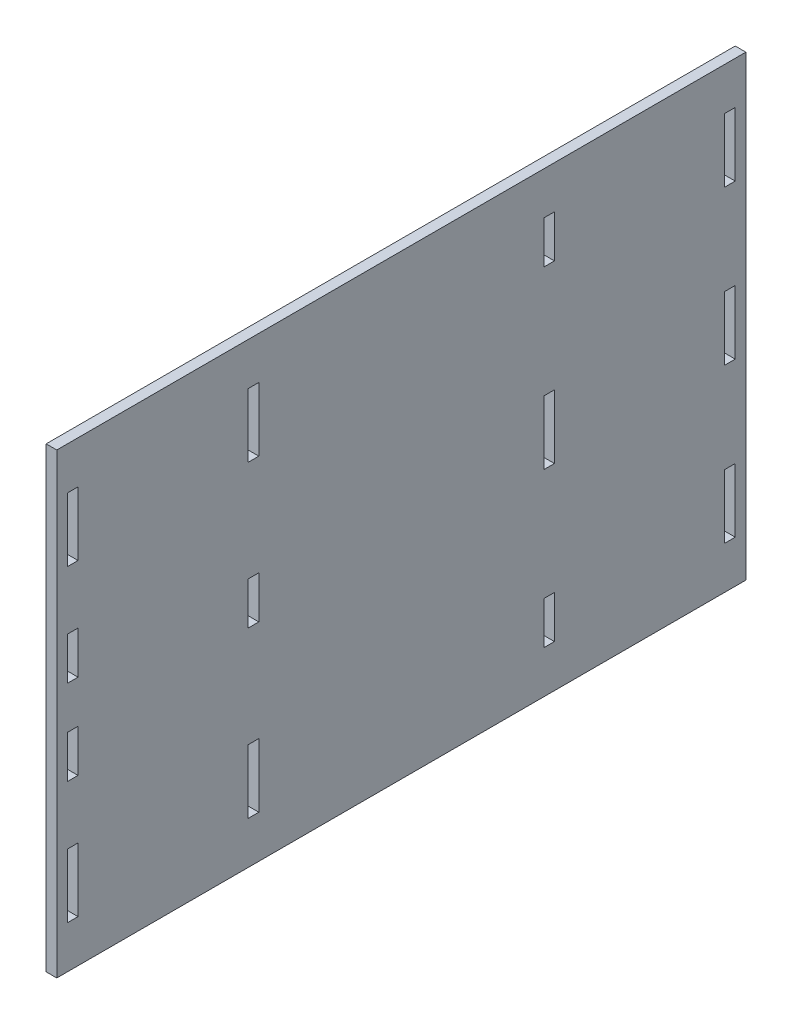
ISO-10303-21;
HEADER;
FILE_DESCRIPTION(('STEP AP214'),'2;1');
FILE_NAME('part.step','',(''),(''),'','','');
FILE_SCHEMA(('AUTOMOTIVE_DESIGN { 1 0 10303 214 1 1 1 1 }'));
ENDSEC;
DATA;
#1=APPLICATION_CONTEXT('core data for automotive mechanical design processes');
#2=APPLICATION_PROTOCOL_DEFINITION('international standard','automotive_design',2000,#1);
#3=PRODUCT_CONTEXT('',#1,'mechanical');
#4=PRODUCT('Part','Part','',(#3));
#5=PRODUCT_RELATED_PRODUCT_CATEGORY('part','',(#4));
#6=PRODUCT_DEFINITION_FORMATION('','',#4);
#7=PRODUCT_DEFINITION_CONTEXT('part definition',#1,'design');
#8=PRODUCT_DEFINITION('design','',#6,#7);
#9=PRODUCT_DEFINITION_SHAPE('','',#8);
#10=(LENGTH_UNIT() NAMED_UNIT(*) SI_UNIT(.MILLI.,.METRE.));
#11=(NAMED_UNIT(*) PLANE_ANGLE_UNIT() SI_UNIT($,.RADIAN.));
#12=(NAMED_UNIT(*) SI_UNIT($,.STERADIAN.) SOLID_ANGLE_UNIT());
#13=UNCERTAINTY_MEASURE_WITH_UNIT(LENGTH_MEASURE(1.E-05),#10,'distance_accuracy_value','');
#14=(GEOMETRIC_REPRESENTATION_CONTEXT(3) GLOBAL_UNCERTAINTY_ASSIGNED_CONTEXT((#13)) GLOBAL_UNIT_ASSIGNED_CONTEXT((#10,
#11,#12)) REPRESENTATION_CONTEXT('',''));
#15=CARTESIAN_POINT('',(0.,0.,0.));
#16=DIRECTION('',(0.,0.,1.));
#17=DIRECTION('',(1.,0.,0.));
#18=AXIS2_PLACEMENT_3D('',#15,#16,#17);
#19=CARTESIAN_POINT('',(3.175,0.,0.));
#20=DIRECTION('',(0.,0.,-1.));
#21=DIRECTION('',(-1.,0.,0.));
#22=AXIS2_PLACEMENT_3D('',#19,#20,#21);
#23=PLANE('',#22);
#24=DIRECTION('',(0.,-1.,0.));
#25=VECTOR('',#24,1.);
#26=CARTESIAN_POINT('',(0.,0.,0.));
#27=LINE('',#26,#25);
#28=CARTESIAN_POINT('',(0.,136.525,0.));
#29=VERTEX_POINT('',#28);
#30=CARTESIAN_POINT('',(0.,0.,0.));
#31=VERTEX_POINT('',#30);
#32=EDGE_CURVE('E799',#29,#31,#27,.T.);
#33=ORIENTED_EDGE('',*,*,#32,.T.);
#34=DIRECTION('',(-1.,0.,0.));
#35=VECTOR('',#34,1.);
#36=CARTESIAN_POINT('',(3.175,0.,0.));
#37=LINE('',#36,#35);
#38=CARTESIAN_POINT('',(3.175,0.,0.));
#39=VERTEX_POINT('',#38);
#40=EDGE_CURVE('E11',#39,#31,#37,.T.);
#41=ORIENTED_EDGE('',*,*,#40,.F.);
#42=DIRECTION('',(0.,-1.,0.));
#43=VECTOR('',#42,1.);
#44=CARTESIAN_POINT('',(3.175,0.,0.));
#45=LINE('',#44,#43);
#46=CARTESIAN_POINT('',(3.175,136.525,0.));
#47=VERTEX_POINT('',#46);
#48=EDGE_CURVE('E806',#47,#39,#45,.T.);
#49=ORIENTED_EDGE('',*,*,#48,.F.);
#50=DIRECTION('',(-1.,0.,0.));
#51=VECTOR('',#50,1.);
#52=CARTESIAN_POINT('',(3.175,136.525,0.));
#53=LINE('',#52,#51);
#54=EDGE_CURVE('E816',#47,#29,#53,.T.);
#55=ORIENTED_EDGE('',*,*,#54,.T.);
#56=EDGE_LOOP('',(#33,#41,#49,#55));
#57=FACE_BOUND('',#56,.T.);
#58=ADVANCED_FACE('F33',(#57),#23,.F.);
#59=CARTESIAN_POINT('',(3.175,0.,0.));
#60=DIRECTION('',(0.,1.,0.));
#61=DIRECTION('',(0.,0.,1.));
#62=AXIS2_PLACEMENT_3D('',#59,#60,#61);
#63=PLANE('',#62);
#64=DIRECTION('',(0.,0.,-1.));
#65=VECTOR('',#64,1.);
#66=CARTESIAN_POINT('',(0.,0.,0.));
#67=LINE('',#66,#65);
#68=CARTESIAN_POINT('',(0.,0.,-205.74));
#69=VERTEX_POINT('',#68);
#70=EDGE_CURVE('E819',#31,#69,#67,.T.);
#71=ORIENTED_EDGE('',*,*,#70,.T.);
#72=DIRECTION('',(-1.,0.,0.));
#73=VECTOR('',#72,1.);
#74=CARTESIAN_POINT('',(3.175,0.,-205.74));
#75=LINE('',#74,#73);
#76=CARTESIAN_POINT('',(3.175,0.,-205.74));
#77=VERTEX_POINT('',#76);
#78=EDGE_CURVE('E40',#77,#69,#75,.T.);
#79=ORIENTED_EDGE('',*,*,#78,.F.);
#80=DIRECTION('',(0.,0.,-1.));
#81=VECTOR('',#80,1.);
#82=CARTESIAN_POINT('',(3.175,0.,0.));
#83=LINE('',#82,#81);
#84=EDGE_CURVE('E809',#39,#77,#83,.T.);
#85=ORIENTED_EDGE('',*,*,#84,.F.);
#86=ORIENTED_EDGE('',*,*,#40,.T.);
#87=EDGE_LOOP('',(#71,#79,#85,#86));
#88=FACE_BOUND('',#87,.T.);
#89=ADVANCED_FACE('F848',(#88),#63,.F.);
#90=CARTESIAN_POINT('',(3.175,0.,-205.74));
#91=DIRECTION('',(0.,0.,1.));
#92=DIRECTION('',(1.,0.,0.));
#93=AXIS2_PLACEMENT_3D('',#90,#91,#92);
#94=PLANE('',#93);
#95=DIRECTION('',(0.,1.,0.));
#96=VECTOR('',#95,1.);
#97=CARTESIAN_POINT('',(0.,0.,-205.74));
#98=LINE('',#97,#96);
#99=CARTESIAN_POINT('',(0.,136.525,-205.74));
#100=VERTEX_POINT('',#99);
#101=EDGE_CURVE('E821',#69,#100,#98,.T.);
#102=ORIENTED_EDGE('',*,*,#101,.T.);
#103=DIRECTION('',(-1.,0.,0.));
#104=VECTOR('',#103,1.);
#105=CARTESIAN_POINT('',(3.175,136.525,-205.74));
#106=LINE('',#105,#104);
#107=CARTESIAN_POINT('',(3.175,136.525,-205.74));
#108=VERTEX_POINT('',#107);
#109=EDGE_CURVE('E826',#108,#100,#106,.T.);
#110=ORIENTED_EDGE('',*,*,#109,.F.);
#111=DIRECTION('',(0.,1.,0.));
#112=VECTOR('',#111,1.);
#113=CARTESIAN_POINT('',(3.175,0.,-205.74));
#114=LINE('',#113,#112);
#115=EDGE_CURVE('E812',#77,#108,#114,.T.);
#116=ORIENTED_EDGE('',*,*,#115,.F.);
#117=ORIENTED_EDGE('',*,*,#78,.T.);
#118=EDGE_LOOP('',(#102,#110,#116,#117));
#119=FACE_BOUND('',#118,.T.);
#120=ADVANCED_FACE('F833',(#119),#94,.F.);
#121=CARTESIAN_POINT('',(3.175,136.525,0.));
#122=DIRECTION('',(0.,-1.,0.));
#123=DIRECTION('',(0.,0.,-1.));
#124=AXIS2_PLACEMENT_3D('',#121,#122,#123);
#125=PLANE('',#124);
#126=DIRECTION('',(0.,0.,1.));
#127=VECTOR('',#126,1.);
#128=CARTESIAN_POINT('',(0.,136.525,0.));
#129=LINE('',#128,#127);
#130=EDGE_CURVE('E810',#100,#29,#129,.T.);
#131=ORIENTED_EDGE('',*,*,#130,.T.);
#132=ORIENTED_EDGE('',*,*,#54,.F.);
#133=DIRECTION('',(0.,0.,1.));
#134=VECTOR('',#133,1.);
#135=CARTESIAN_POINT('',(3.175,136.525,0.));
#136=LINE('',#135,#134);
#137=EDGE_CURVE('E814',#108,#47,#136,.T.);
#138=ORIENTED_EDGE('',*,*,#137,.F.);
#139=ORIENTED_EDGE('',*,*,#109,.T.);
#140=EDGE_LOOP('',(#131,#132,#138,#139));
#141=FACE_BOUND('',#140,.T.);
#142=ADVANCED_FACE('F841',(#141),#125,.F.);
#143=CARTESIAN_POINT('',(3.175,0.,0.));
#144=DIRECTION('',(-1.,0.,0.));
#145=DIRECTION('',(0.,0.,1.));
#146=AXIS2_PLACEMENT_3D('',#143,#144,#145);
#147=PLANE('',#146);
#148=DIRECTION('',(0.,1.,0.));
#149=VECTOR('',#148,1.);
#150=CARTESIAN_POINT('',(3.175,12.7,-202.565));
#151=LINE('',#150,#149);
#152=CARTESIAN_POINT('',(3.175,12.7,-202.565));
#153=VERTEX_POINT('',#152);
#154=CARTESIAN_POINT('',(3.175,31.75,-202.565));
#155=VERTEX_POINT('',#154);
#156=EDGE_CURVE('E412',#153,#155,#151,.T.);
#157=ORIENTED_EDGE('',*,*,#156,.F.);
#158=DIRECTION('',(0.,0.,-1.));
#159=VECTOR('',#158,1.);
#160=CARTESIAN_POINT('',(3.175,12.7,-199.39));
#161=LINE('',#160,#159);
#162=CARTESIAN_POINT('',(3.175,12.7,-199.39));
#163=VERTEX_POINT('',#162);
#164=EDGE_CURVE('E47',#163,#153,#161,.T.);
#165=ORIENTED_EDGE('',*,*,#164,.F.);
#166=DIRECTION('',(0.,-1.,0.));
#167=VECTOR('',#166,1.);
#168=CARTESIAN_POINT('',(3.175,12.7,-199.39));
#169=LINE('',#168,#167);
#170=CARTESIAN_POINT('',(3.175,31.75,-199.39));
#171=VERTEX_POINT('',#170);
#172=EDGE_CURVE('E403',#171,#163,#169,.T.);
#173=ORIENTED_EDGE('',*,*,#172,.F.);
#174=DIRECTION('',(0.,0.,1.));
#175=VECTOR('',#174,1.);
#176=CARTESIAN_POINT('',(3.175,31.75,-199.39));
#177=LINE('',#176,#175);
#178=EDGE_CURVE('E406',#155,#171,#177,.T.);
#179=ORIENTED_EDGE('',*,*,#178,.F.);
#180=EDGE_LOOP('',(#157,#165,#173,#179));
#181=FACE_BOUND('',#180,.T.);
#182=DIRECTION('',(0.,0.,-1.));
#183=VECTOR('',#182,1.);
#184=CARTESIAN_POINT('',(3.175,58.7375,-199.39));
#185=LINE('',#184,#183);
#186=CARTESIAN_POINT('',(3.175,58.7375,-199.39));
#187=VERTEX_POINT('',#186);
#188=CARTESIAN_POINT('',(3.175,58.7375,-202.565));
#189=VERTEX_POINT('',#188);
#190=EDGE_CURVE('E437',#187,#189,#185,.T.);
#191=ORIENTED_EDGE('',*,*,#190,.F.);
#192=DIRECTION('',(0.,-1.,0.));
#193=VECTOR('',#192,1.);
#194=CARTESIAN_POINT('',(3.175,77.7875,-199.39));
#195=LINE('',#194,#193);
#196=CARTESIAN_POINT('',(3.175,77.7875,-199.39));
#197=VERTEX_POINT('',#196);
#198=EDGE_CURVE('E418',#197,#187,#195,.T.);
#199=ORIENTED_EDGE('',*,*,#198,.F.);
#200=DIRECTION('',(0.,0.,1.));
#201=VECTOR('',#200,1.);
#202=CARTESIAN_POINT('',(3.175,77.7875,-199.39));
#203=LINE('',#202,#201);
#204=CARTESIAN_POINT('',(3.175,77.7875,-202.565));
#205=VERTEX_POINT('',#204);
#206=EDGE_CURVE('E426',#205,#197,#203,.T.);
#207=ORIENTED_EDGE('',*,*,#206,.F.);
#208=DIRECTION('',(0.,1.,0.));
#209=VECTOR('',#208,1.);
#210=CARTESIAN_POINT('',(3.175,77.7875,-202.565));
#211=LINE('',#210,#209);
#212=EDGE_CURVE('E440',#189,#205,#211,.T.);
#213=ORIENTED_EDGE('',*,*,#212,.F.);
#214=EDGE_LOOP('',(#191,#199,#207,#213));
#215=FACE_BOUND('',#214,.T.);
#216=DIRECTION('',(0.,0.,-1.));
#217=VECTOR('',#216,1.);
#218=CARTESIAN_POINT('',(3.175,104.775,-199.39));
#219=LINE('',#218,#217);
#220=CARTESIAN_POINT('',(3.175,104.775,-199.39));
#221=VERTEX_POINT('',#220);
#222=CARTESIAN_POINT('',(3.175,104.775,-202.565));
#223=VERTEX_POINT('',#222);
#224=EDGE_CURVE('E469',#221,#223,#219,.T.);
#225=ORIENTED_EDGE('',*,*,#224,.F.);
#226=DIRECTION('',(0.,-1.,0.));
#227=VECTOR('',#226,1.);
#228=CARTESIAN_POINT('',(3.175,123.825,-199.39));
#229=LINE('',#228,#227);
#230=CARTESIAN_POINT('',(3.175,123.825,-199.39));
#231=VERTEX_POINT('',#230);
#232=EDGE_CURVE('E447',#231,#221,#229,.T.);
#233=ORIENTED_EDGE('',*,*,#232,.F.);
#234=DIRECTION('',(0.,0.,1.));
#235=VECTOR('',#234,1.);
#236=CARTESIAN_POINT('',(3.175,123.825,-199.39));
#237=LINE('',#236,#235);
#238=CARTESIAN_POINT('',(3.175,123.825,-202.565));
#239=VERTEX_POINT('',#238);
#240=EDGE_CURVE('E458',#239,#231,#237,.T.);
#241=ORIENTED_EDGE('',*,*,#240,.F.);
#242=DIRECTION('',(0.,1.,0.));
#243=VECTOR('',#242,1.);
#244=CARTESIAN_POINT('',(3.175,123.825,-202.565));
#245=LINE('',#244,#243);
#246=EDGE_CURVE('E472',#223,#239,#245,.T.);
#247=ORIENTED_EDGE('',*,*,#246,.F.);
#248=EDGE_LOOP('',(#225,#233,#241,#247));
#249=FACE_BOUND('',#248,.T.);
#250=DIRECTION('',(0.,1.,0.));
#251=VECTOR('',#250,1.);
#252=CARTESIAN_POINT('',(3.175,12.7,-148.59));
#253=LINE('',#252,#251);
#254=CARTESIAN_POINT('',(3.175,12.7,-148.59));
#255=VERTEX_POINT('',#254);
#256=CARTESIAN_POINT('',(3.175,25.4,-148.59));
#257=VERTEX_POINT('',#256);
#258=EDGE_CURVE('E501',#255,#257,#253,.T.);
#259=ORIENTED_EDGE('',*,*,#258,.F.);
#260=DIRECTION('',(0.,0.,-1.));
#261=VECTOR('',#260,1.);
#262=CARTESIAN_POINT('',(3.175,12.7,-145.415));
#263=LINE('',#262,#261);
#264=CARTESIAN_POINT('',(3.175,12.7,-145.415));
#265=VERTEX_POINT('',#264);
#266=EDGE_CURVE('E479',#265,#255,#263,.T.);
#267=ORIENTED_EDGE('',*,*,#266,.F.);
#268=DIRECTION('',(0.,-1.,0.));
#269=VECTOR('',#268,1.);
#270=CARTESIAN_POINT('',(3.175,12.7,-145.415));
#271=LINE('',#270,#269);
#272=CARTESIAN_POINT('',(3.175,25.4,-145.415));
#273=VERTEX_POINT('',#272);
#274=EDGE_CURVE('E490',#273,#265,#271,.T.);
#275=ORIENTED_EDGE('',*,*,#274,.F.);
#276=DIRECTION('',(0.,0.,1.));
#277=VECTOR('',#276,1.);
#278=CARTESIAN_POINT('',(3.175,25.4,-145.415));
#279=LINE('',#278,#277);
#280=EDGE_CURVE('E504',#257,#273,#279,.T.);
#281=ORIENTED_EDGE('',*,*,#280,.F.);
#282=EDGE_LOOP('',(#259,#267,#275,#281));
#283=FACE_BOUND('',#282,.T.);
#284=DIRECTION('',(0.,0.,-1.));
#285=VECTOR('',#284,1.);
#286=CARTESIAN_POINT('',(3.175,58.7375,-145.415));
#287=LINE('',#286,#285);
#288=CARTESIAN_POINT('',(3.175,58.7375,-145.415));
#289=VERTEX_POINT('',#288);
#290=CARTESIAN_POINT('',(3.175,58.7375,-148.59));
#291=VERTEX_POINT('',#290);
#292=EDGE_CURVE('E533',#289,#291,#287,.T.);
#293=ORIENTED_EDGE('',*,*,#292,.F.);
#294=DIRECTION('',(0.,-1.,0.));
#295=VECTOR('',#294,1.);
#296=CARTESIAN_POINT('',(3.175,77.7875,-145.415));
#297=LINE('',#296,#295);
#298=CARTESIAN_POINT('',(3.175,77.7875,-145.415));
#299=VERTEX_POINT('',#298);
#300=EDGE_CURVE('E511',#299,#289,#297,.T.);
#301=ORIENTED_EDGE('',*,*,#300,.F.);
#302=DIRECTION('',(0.,0.,1.));
#303=VECTOR('',#302,1.);
#304=CARTESIAN_POINT('',(3.175,77.7875,-145.415));
#305=LINE('',#304,#303);
#306=CARTESIAN_POINT('',(3.175,77.7875,-148.59));
#307=VERTEX_POINT('',#306);
#308=EDGE_CURVE('E522',#307,#299,#305,.T.);
#309=ORIENTED_EDGE('',*,*,#308,.F.);
#310=DIRECTION('',(0.,1.,0.));
#311=VECTOR('',#310,1.);
#312=CARTESIAN_POINT('',(3.175,77.7875,-148.59));
#313=LINE('',#312,#311);
#314=EDGE_CURVE('E536',#291,#307,#313,.T.);
#315=ORIENTED_EDGE('',*,*,#314,.F.);
#316=EDGE_LOOP('',(#293,#301,#309,#315));
#317=FACE_BOUND('',#316,.T.);
#318=DIRECTION('',(0.,1.,0.));
#319=VECTOR('',#318,1.);
#320=CARTESIAN_POINT('',(3.175,12.7,-60.325));
#321=LINE('',#320,#319);
#322=CARTESIAN_POINT('',(3.175,12.7,-60.325));
#323=VERTEX_POINT('',#322);
#324=CARTESIAN_POINT('',(3.175,31.75,-60.325));
#325=VERTEX_POINT('',#324);
#326=EDGE_CURVE('E565',#323,#325,#321,.T.);
#327=ORIENTED_EDGE('',*,*,#326,.F.);
#328=DIRECTION('',(0.,0.,-1.));
#329=VECTOR('',#328,1.);
#330=CARTESIAN_POINT('',(3.175,12.7,-57.15));
#331=LINE('',#330,#329);
#332=CARTESIAN_POINT('',(3.175,12.7,-57.15));
#333=VERTEX_POINT('',#332);
#334=EDGE_CURVE('E543',#333,#323,#331,.T.);
#335=ORIENTED_EDGE('',*,*,#334,.F.);
#336=DIRECTION('',(0.,-1.,0.));
#337=VECTOR('',#336,1.);
#338=CARTESIAN_POINT('',(3.175,12.7,-57.15));
#339=LINE('',#338,#337);
#340=CARTESIAN_POINT('',(3.175,31.75,-57.15));
#341=VERTEX_POINT('',#340);
#342=EDGE_CURVE('E554',#341,#333,#339,.T.);
#343=ORIENTED_EDGE('',*,*,#342,.F.);
#344=DIRECTION('',(0.,0.,1.));
#345=VECTOR('',#344,1.);
#346=CARTESIAN_POINT('',(3.175,31.75,-57.15));
#347=LINE('',#346,#345);
#348=EDGE_CURVE('E568',#325,#341,#347,.T.);
#349=ORIENTED_EDGE('',*,*,#348,.F.);
#350=EDGE_LOOP('',(#327,#335,#343,#349));
#351=FACE_BOUND('',#350,.T.);
#352=DIRECTION('',(0.,0.,-1.));
#353=VECTOR('',#352,1.);
#354=CARTESIAN_POINT('',(3.175,61.9125,-57.15));
#355=LINE('',#354,#353);
#356=CARTESIAN_POINT('',(3.175,61.9125,-57.15));
#357=VERTEX_POINT('',#356);
#358=CARTESIAN_POINT('',(3.175,61.9125,-60.325));
#359=VERTEX_POINT('',#358);
#360=EDGE_CURVE('E597',#357,#359,#355,.T.);
#361=ORIENTED_EDGE('',*,*,#360,.F.);
#362=DIRECTION('',(0.,-1.,0.));
#363=VECTOR('',#362,1.);
#364=CARTESIAN_POINT('',(3.175,74.6125,-57.15));
#365=LINE('',#364,#363);
#366=CARTESIAN_POINT('',(3.175,74.6125,-57.15));
#367=VERTEX_POINT('',#366);
#368=EDGE_CURVE('E575',#367,#357,#365,.T.);
#369=ORIENTED_EDGE('',*,*,#368,.F.);
#370=DIRECTION('',(0.,0.,1.));
#371=VECTOR('',#370,1.);
#372=CARTESIAN_POINT('',(3.175,74.6125,-57.15));
#373=LINE('',#372,#371);
#374=CARTESIAN_POINT('',(3.175,74.6125,-60.325));
#375=VERTEX_POINT('',#374);
#376=EDGE_CURVE('E586',#375,#367,#373,.T.);
#377=ORIENTED_EDGE('',*,*,#376,.F.);
#378=DIRECTION('',(0.,1.,0.));
#379=VECTOR('',#378,1.);
#380=CARTESIAN_POINT('',(3.175,74.6125,-60.325));
#381=LINE('',#380,#379);
#382=EDGE_CURVE('E600',#359,#375,#381,.T.);
#383=ORIENTED_EDGE('',*,*,#382,.F.);
#384=EDGE_LOOP('',(#361,#369,#377,#383));
#385=FACE_BOUND('',#384,.T.);
#386=DIRECTION('',(0.,0.,-1.));
#387=VECTOR('',#386,1.);
#388=CARTESIAN_POINT('',(3.175,104.775,-57.15));
#389=LINE('',#388,#387);
#390=CARTESIAN_POINT('',(3.175,104.775,-57.15));
#391=VERTEX_POINT('',#390);
#392=CARTESIAN_POINT('',(3.175,104.775,-60.325));
#393=VERTEX_POINT('',#392);
#394=EDGE_CURVE('E629',#391,#393,#389,.T.);
#395=ORIENTED_EDGE('',*,*,#394,.F.);
#396=DIRECTION('',(0.,-1.,0.));
#397=VECTOR('',#396,1.);
#398=CARTESIAN_POINT('',(3.175,123.825,-57.15));
#399=LINE('',#398,#397);
#400=CARTESIAN_POINT('',(3.175,123.825,-57.15));
#401=VERTEX_POINT('',#400);
#402=EDGE_CURVE('E607',#401,#391,#399,.T.);
#403=ORIENTED_EDGE('',*,*,#402,.F.);
#404=DIRECTION('',(0.,0.,1.));
#405=VECTOR('',#404,1.);
#406=CARTESIAN_POINT('',(3.175,123.825,-57.15));
#407=LINE('',#406,#405);
#408=CARTESIAN_POINT('',(3.175,123.825,-60.325));
#409=VERTEX_POINT('',#408);
#410=EDGE_CURVE('E618',#409,#401,#407,.T.);
#411=ORIENTED_EDGE('',*,*,#410,.F.);
#412=DIRECTION('',(0.,1.,0.));
#413=VECTOR('',#412,1.);
#414=CARTESIAN_POINT('',(3.175,123.825,-60.325));
#415=LINE('',#414,#413);
#416=EDGE_CURVE('E632',#393,#409,#415,.T.);
#417=ORIENTED_EDGE('',*,*,#416,.F.);
#418=EDGE_LOOP('',(#395,#403,#411,#417));
#419=FACE_BOUND('',#418,.T.);
#420=DIRECTION('',(0.,1.,0.));
#421=VECTOR('',#420,1.);
#422=CARTESIAN_POINT('',(3.175,12.7,-6.35));
#423=LINE('',#422,#421);
#424=CARTESIAN_POINT('',(3.175,12.7,-6.35));
#425=VERTEX_POINT('',#424);
#426=CARTESIAN_POINT('',(3.175,31.75,-6.35));
#427=VERTEX_POINT('',#426);
#428=EDGE_CURVE('E661',#425,#427,#423,.T.);
#429=ORIENTED_EDGE('',*,*,#428,.F.);
#430=DIRECTION('',(0.,0.,-1.));
#431=VECTOR('',#430,1.);
#432=CARTESIAN_POINT('',(3.175,12.7,-3.17500000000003));
#433=LINE('',#432,#431);
#434=CARTESIAN_POINT('',(3.175,12.7,-3.17500000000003));
#435=VERTEX_POINT('',#434);
#436=EDGE_CURVE('E639',#435,#425,#433,.T.);
#437=ORIENTED_EDGE('',*,*,#436,.F.);
#438=DIRECTION('',(0.,-1.,0.));
#439=VECTOR('',#438,1.);
#440=CARTESIAN_POINT('',(3.175,12.7,-3.17500000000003));
#441=LINE('',#440,#439);
#442=CARTESIAN_POINT('',(3.175,31.75,-3.17500000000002));
#443=VERTEX_POINT('',#442);
#444=EDGE_CURVE('E650',#443,#435,#441,.T.);
#445=ORIENTED_EDGE('',*,*,#444,.F.);
#446=DIRECTION('',(0.,0.,1.));
#447=VECTOR('',#446,1.);
#448=CARTESIAN_POINT('',(3.175,31.75,-3.17500000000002));
#449=LINE('',#448,#447);
#450=EDGE_CURVE('E664',#427,#443,#449,.T.);
#451=ORIENTED_EDGE('',*,*,#450,.F.);
#452=EDGE_LOOP('',(#429,#437,#445,#451));
#453=FACE_BOUND('',#452,.T.);
#454=DIRECTION('',(0.,0.,-1.));
#455=VECTOR('',#454,1.);
#456=CARTESIAN_POINT('',(3.175,49.2125,-3.17500000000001));
#457=LINE('',#456,#455);
#458=CARTESIAN_POINT('',(3.175,49.2125,-3.17500000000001));
#459=VERTEX_POINT('',#458);
#460=CARTESIAN_POINT('',(3.175,49.2125,-6.35000000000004));
#461=VERTEX_POINT('',#460);
#462=EDGE_CURVE('E693',#459,#461,#457,.T.);
#463=ORIENTED_EDGE('',*,*,#462,.F.);
#464=DIRECTION('',(0.,-1.,0.));
#465=VECTOR('',#464,1.);
#466=CARTESIAN_POINT('',(3.175,61.9125,-3.17500000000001));
#467=LINE('',#466,#465);
#468=CARTESIAN_POINT('',(3.175,61.9125,-3.17500000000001));
#469=VERTEX_POINT('',#468);
#470=EDGE_CURVE('E671',#469,#459,#467,.T.);
#471=ORIENTED_EDGE('',*,*,#470,.F.);
#472=DIRECTION('',(0.,0.,1.));
#473=VECTOR('',#472,1.);
#474=CARTESIAN_POINT('',(3.175,61.9125,-3.17500000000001));
#475=LINE('',#474,#473);
#476=CARTESIAN_POINT('',(3.175,61.9125,-6.35000000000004));
#477=VERTEX_POINT('',#476);
#478=EDGE_CURVE('E682',#477,#469,#475,.T.);
#479=ORIENTED_EDGE('',*,*,#478,.F.);
#480=DIRECTION('',(0.,1.,0.));
#481=VECTOR('',#480,1.);
#482=CARTESIAN_POINT('',(3.175,61.9125,-6.35000000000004));
#483=LINE('',#482,#481);
#484=EDGE_CURVE('E696',#461,#477,#483,.T.);
#485=ORIENTED_EDGE('',*,*,#484,.F.);
#486=EDGE_LOOP('',(#463,#471,#479,#485));
#487=FACE_BOUND('',#486,.T.);
#488=DIRECTION('',(0.,0.,-1.));
#489=VECTOR('',#488,1.);
#490=CARTESIAN_POINT('',(3.175,111.125,-145.415));
#491=LINE('',#490,#489);
#492=CARTESIAN_POINT('',(3.175,111.125,-145.415));
#493=VERTEX_POINT('',#492);
#494=CARTESIAN_POINT('',(3.175,111.125,-148.59));
#495=VERTEX_POINT('',#494);
#496=EDGE_CURVE('E725',#493,#495,#491,.T.);
#497=ORIENTED_EDGE('',*,*,#496,.F.);
#498=DIRECTION('',(0.,-1.,0.));
#499=VECTOR('',#498,1.);
#500=CARTESIAN_POINT('',(3.175,123.825,-145.415));
#501=LINE('',#500,#499);
#502=CARTESIAN_POINT('',(3.175,123.825,-145.415));
#503=VERTEX_POINT('',#502);
#504=EDGE_CURVE('E703',#503,#493,#501,.T.);
#505=ORIENTED_EDGE('',*,*,#504,.F.);
#506=DIRECTION('',(0.,0.,1.));
#507=VECTOR('',#506,1.);
#508=CARTESIAN_POINT('',(3.175,123.825,-145.415));
#509=LINE('',#508,#507);
#510=CARTESIAN_POINT('',(3.175,123.825,-148.59));
#511=VERTEX_POINT('',#510);
#512=EDGE_CURVE('E714',#511,#503,#509,.T.);
#513=ORIENTED_EDGE('',*,*,#512,.F.);
#514=DIRECTION('',(0.,1.,0.));
#515=VECTOR('',#514,1.);
#516=CARTESIAN_POINT('',(3.175,123.825,-148.59));
#517=LINE('',#516,#515);
#518=EDGE_CURVE('E728',#495,#511,#517,.T.);
#519=ORIENTED_EDGE('',*,*,#518,.F.);
#520=EDGE_LOOP('',(#497,#505,#513,#519));
#521=FACE_BOUND('',#520,.T.);
#522=DIRECTION('',(0.,0.,-1.));
#523=VECTOR('',#522,1.);
#524=CARTESIAN_POINT('',(3.175,74.6125,-3.17500000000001));
#525=LINE('',#524,#523);
#526=CARTESIAN_POINT('',(3.175,74.6125,-3.17500000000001));
#527=VERTEX_POINT('',#526);
#528=CARTESIAN_POINT('',(3.175,74.6125,-6.35000000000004));
#529=VERTEX_POINT('',#528);
#530=EDGE_CURVE('E757',#527,#529,#525,.T.);
#531=ORIENTED_EDGE('',*,*,#530,.F.);
#532=DIRECTION('',(0.,-1.,0.));
#533=VECTOR('',#532,1.);
#534=CARTESIAN_POINT('',(3.175,87.3125,-3.17500000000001));
#535=LINE('',#534,#533);
#536=CARTESIAN_POINT('',(3.175,87.3125,-3.17500000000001));
#537=VERTEX_POINT('',#536);
#538=EDGE_CURVE('E735',#537,#527,#535,.T.);
#539=ORIENTED_EDGE('',*,*,#538,.F.);
#540=DIRECTION('',(0.,0.,1.));
#541=VECTOR('',#540,1.);
#542=CARTESIAN_POINT('',(3.175,87.3125,-3.17500000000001));
#543=LINE('',#542,#541);
#544=CARTESIAN_POINT('',(3.175,87.3125,-6.35000000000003));
#545=VERTEX_POINT('',#544);
#546=EDGE_CURVE('E746',#545,#537,#543,.T.);
#547=ORIENTED_EDGE('',*,*,#546,.F.);
#548=DIRECTION('',(0.,1.,0.));
#549=VECTOR('',#548,1.);
#550=CARTESIAN_POINT('',(3.175,87.3125,-6.35000000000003));
#551=LINE('',#550,#549);
#552=EDGE_CURVE('E760',#529,#545,#551,.T.);
#553=ORIENTED_EDGE('',*,*,#552,.F.);
#554=EDGE_LOOP('',(#531,#539,#547,#553));
#555=FACE_BOUND('',#554,.T.);
#556=DIRECTION('',(0.,0.,-1.));
#557=VECTOR('',#556,1.);
#558=CARTESIAN_POINT('',(3.175,104.775,-3.17500000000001));
#559=LINE('',#558,#557);
#560=CARTESIAN_POINT('',(3.175,104.775,-3.17500000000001));
#561=VERTEX_POINT('',#560);
#562=CARTESIAN_POINT('',(3.175,104.775,-6.35000000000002));
#563=VERTEX_POINT('',#562);
#564=EDGE_CURVE('E789',#561,#563,#559,.T.);
#565=ORIENTED_EDGE('',*,*,#564,.F.);
#566=DIRECTION('',(0.,-1.,0.));
#567=VECTOR('',#566,1.);
#568=CARTESIAN_POINT('',(3.175,123.825,-3.17500000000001));
#569=LINE('',#568,#567);
#570=CARTESIAN_POINT('',(3.175,123.825,-3.17500000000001));
#571=VERTEX_POINT('',#570);
#572=EDGE_CURVE('E767',#571,#561,#569,.T.);
#573=ORIENTED_EDGE('',*,*,#572,.F.);
#574=DIRECTION('',(0.,0.,1.));
#575=VECTOR('',#574,1.);
#576=CARTESIAN_POINT('',(3.175,123.825,-3.17500000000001));
#577=LINE('',#576,#575);
#578=CARTESIAN_POINT('',(3.175,123.825,-6.35000000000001));
#579=VERTEX_POINT('',#578);
#580=EDGE_CURVE('E778',#579,#571,#577,.T.);
#581=ORIENTED_EDGE('',*,*,#580,.F.);
#582=DIRECTION('',(0.,1.,0.));
#583=VECTOR('',#582,1.);
#584=CARTESIAN_POINT('',(3.175,123.825,-6.35000000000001));
#585=LINE('',#584,#583);
#586=EDGE_CURVE('E792',#563,#579,#585,.T.);
#587=ORIENTED_EDGE('',*,*,#586,.F.);
#588=EDGE_LOOP('',(#565,#573,#581,#587));
#589=FACE_BOUND('',#588,.T.);
#590=ORIENTED_EDGE('',*,*,#48,.T.);
#591=ORIENTED_EDGE('',*,*,#84,.T.);
#592=ORIENTED_EDGE('',*,*,#115,.T.);
#593=ORIENTED_EDGE('',*,*,#137,.T.);
#594=EDGE_LOOP('',(#590,#591,#592,#593));
#595=FACE_BOUND('',#594,.T.);
#596=ADVANCED_FACE('F847',(#181,#215,#249,#283,#317,#351,#385,#419,#453,#487,#521,#555,#589,
#595),#147,.F.);
#597=CARTESIAN_POINT('',(0.,0.,0.));
#598=DIRECTION('',(-1.,0.,0.));
#599=DIRECTION('',(0.,0.,1.));
#600=AXIS2_PLACEMENT_3D('',#597,#598,#599);
#601=PLANE('',#600);
#602=DIRECTION('',(0.,0.,-1.));
#603=VECTOR('',#602,1.);
#604=CARTESIAN_POINT('',(0.,12.7,-199.39));
#605=LINE('',#604,#603);
#606=CARTESIAN_POINT('',(0.,12.7,-199.39));
#607=VERTEX_POINT('',#606);
#608=CARTESIAN_POINT('',(0.,12.7,-202.565));
#609=VERTEX_POINT('',#608);
#610=EDGE_CURVE('E387',#607,#609,#605,.T.);
#611=ORIENTED_EDGE('',*,*,#610,.T.);
#612=DIRECTION('',(0.,1.,0.));
#613=VECTOR('',#612,1.);
#614=CARTESIAN_POINT('',(0.,12.7,-202.565));
#615=LINE('',#614,#613);
#616=CARTESIAN_POINT('',(0.,31.75,-202.565));
#617=VERTEX_POINT('',#616);
#618=EDGE_CURVE('E396',#609,#617,#615,.T.);
#619=ORIENTED_EDGE('',*,*,#618,.T.);
#620=DIRECTION('',(0.,0.,1.));
#621=VECTOR('',#620,1.);
#622=CARTESIAN_POINT('',(0.,31.75,-199.39));
#623=LINE('',#622,#621);
#624=CARTESIAN_POINT('',(0.,31.75,-199.39));
#625=VERTEX_POINT('',#624);
#626=EDGE_CURVE('E55',#617,#625,#623,.T.);
#627=ORIENTED_EDGE('',*,*,#626,.T.);
#628=DIRECTION('',(0.,-1.,0.));
#629=VECTOR('',#628,1.);
#630=CARTESIAN_POINT('',(0.,12.7,-199.39));
#631=LINE('',#630,#629);
#632=EDGE_CURVE('E393',#625,#607,#631,.T.);
#633=ORIENTED_EDGE('',*,*,#632,.T.);
#634=EDGE_LOOP('',(#611,#619,#627,#633));
#635=FACE_BOUND('',#634,.T.);
#636=DIRECTION('',(0.,-1.,0.));
#637=VECTOR('',#636,1.);
#638=CARTESIAN_POINT('',(0.,77.7875,-199.39));
#639=LINE('',#638,#637);
#640=CARTESIAN_POINT('',(0.,77.7875,-199.39));
#641=VERTEX_POINT('',#640);
#642=CARTESIAN_POINT('',(0.,58.7375,-199.39));
#643=VERTEX_POINT('',#642);
#644=EDGE_CURVE('E422',#641,#643,#639,.T.);
#645=ORIENTED_EDGE('',*,*,#644,.T.);
#646=DIRECTION('',(0.,0.,-1.));
#647=VECTOR('',#646,1.);
#648=CARTESIAN_POINT('',(0.,58.7375,-199.39));
#649=LINE('',#648,#647);
#650=CARTESIAN_POINT('',(0.,58.7375,-202.565));
#651=VERTEX_POINT('',#650);
#652=EDGE_CURVE('E425',#643,#651,#649,.T.);
#653=ORIENTED_EDGE('',*,*,#652,.T.);
#654=DIRECTION('',(0.,1.,0.));
#655=VECTOR('',#654,1.);
#656=CARTESIAN_POINT('',(0.,77.7875,-202.565));
#657=LINE('',#656,#655);
#658=CARTESIAN_POINT('',(0.,77.7875,-202.565));
#659=VERTEX_POINT('',#658);
#660=EDGE_CURVE('E429',#651,#659,#657,.T.);
#661=ORIENTED_EDGE('',*,*,#660,.T.);
#662=DIRECTION('',(0.,0.,1.));
#663=VECTOR('',#662,1.);
#664=CARTESIAN_POINT('',(0.,77.7875,-199.39));
#665=LINE('',#664,#663);
#666=EDGE_CURVE('E432',#659,#641,#665,.T.);
#667=ORIENTED_EDGE('',*,*,#666,.T.);
#668=EDGE_LOOP('',(#645,#653,#661,#667));
#669=FACE_BOUND('',#668,.T.);
#670=DIRECTION('',(0.,-1.,0.));
#671=VECTOR('',#670,1.);
#672=CARTESIAN_POINT('',(0.,123.825,-199.39));
#673=LINE('',#672,#671);
#674=CARTESIAN_POINT('',(0.,123.825,-199.39));
#675=VERTEX_POINT('',#674);
#676=CARTESIAN_POINT('',(0.,104.775,-199.39));
#677=VERTEX_POINT('',#676);
#678=EDGE_CURVE('E454',#675,#677,#673,.T.);
#679=ORIENTED_EDGE('',*,*,#678,.T.);
#680=DIRECTION('',(0.,0.,-1.));
#681=VECTOR('',#680,1.);
#682=CARTESIAN_POINT('',(0.,104.775,-199.39));
#683=LINE('',#682,#681);
#684=CARTESIAN_POINT('',(0.,104.775,-202.565));
#685=VERTEX_POINT('',#684);
#686=EDGE_CURVE('E457',#677,#685,#683,.T.);
#687=ORIENTED_EDGE('',*,*,#686,.T.);
#688=DIRECTION('',(0.,1.,0.));
#689=VECTOR('',#688,1.);
#690=CARTESIAN_POINT('',(0.,123.825,-202.565));
#691=LINE('',#690,#689);
#692=CARTESIAN_POINT('',(0.,123.825,-202.565));
#693=VERTEX_POINT('',#692);
#694=EDGE_CURVE('E461',#685,#693,#691,.T.);
#695=ORIENTED_EDGE('',*,*,#694,.T.);
#696=DIRECTION('',(0.,0.,1.));
#697=VECTOR('',#696,1.);
#698=CARTESIAN_POINT('',(0.,123.825,-199.39));
#699=LINE('',#698,#697);
#700=EDGE_CURVE('E464',#693,#675,#699,.T.);
#701=ORIENTED_EDGE('',*,*,#700,.T.);
#702=EDGE_LOOP('',(#679,#687,#695,#701));
#703=FACE_BOUND('',#702,.T.);
#704=DIRECTION('',(0.,0.,-1.));
#705=VECTOR('',#704,1.);
#706=CARTESIAN_POINT('',(0.,12.7,-145.415));
#707=LINE('',#706,#705);
#708=CARTESIAN_POINT('',(0.,12.7,-145.415));
#709=VERTEX_POINT('',#708);
#710=CARTESIAN_POINT('',(0.,12.7,-148.59));
#711=VERTEX_POINT('',#710);
#712=EDGE_CURVE('E486',#709,#711,#707,.T.);
#713=ORIENTED_EDGE('',*,*,#712,.T.);
#714=DIRECTION('',(0.,1.,0.));
#715=VECTOR('',#714,1.);
#716=CARTESIAN_POINT('',(0.,12.7,-148.59));
#717=LINE('',#716,#715);
#718=CARTESIAN_POINT('',(0.,25.4,-148.59));
#719=VERTEX_POINT('',#718);
#720=EDGE_CURVE('E489',#711,#719,#717,.T.);
#721=ORIENTED_EDGE('',*,*,#720,.T.);
#722=DIRECTION('',(0.,0.,1.));
#723=VECTOR('',#722,1.);
#724=CARTESIAN_POINT('',(0.,25.4,-145.415));
#725=LINE('',#724,#723);
#726=CARTESIAN_POINT('',(0.,25.4,-145.415));
#727=VERTEX_POINT('',#726);
#728=EDGE_CURVE('E493',#719,#727,#725,.T.);
#729=ORIENTED_EDGE('',*,*,#728,.T.);
#730=DIRECTION('',(0.,-1.,0.));
#731=VECTOR('',#730,1.);
#732=CARTESIAN_POINT('',(0.,12.7,-145.415));
#733=LINE('',#732,#731);
#734=EDGE_CURVE('E496',#727,#709,#733,.T.);
#735=ORIENTED_EDGE('',*,*,#734,.T.);
#736=EDGE_LOOP('',(#713,#721,#729,#735));
#737=FACE_BOUND('',#736,.T.);
#738=DIRECTION('',(0.,-1.,0.));
#739=VECTOR('',#738,1.);
#740=CARTESIAN_POINT('',(0.,77.7875,-145.415));
#741=LINE('',#740,#739);
#742=CARTESIAN_POINT('',(0.,77.7875,-145.415));
#743=VERTEX_POINT('',#742);
#744=CARTESIAN_POINT('',(0.,58.7375,-145.415));
#745=VERTEX_POINT('',#744);
#746=EDGE_CURVE('E518',#743,#745,#741,.T.);
#747=ORIENTED_EDGE('',*,*,#746,.T.);
#748=DIRECTION('',(0.,0.,-1.));
#749=VECTOR('',#748,1.);
#750=CARTESIAN_POINT('',(0.,58.7375,-145.415));
#751=LINE('',#750,#749);
#752=CARTESIAN_POINT('',(0.,58.7375,-148.59));
#753=VERTEX_POINT('',#752);
#754=EDGE_CURVE('E521',#745,#753,#751,.T.);
#755=ORIENTED_EDGE('',*,*,#754,.T.);
#756=DIRECTION('',(0.,1.,0.));
#757=VECTOR('',#756,1.);
#758=CARTESIAN_POINT('',(0.,77.7875,-148.59));
#759=LINE('',#758,#757);
#760=CARTESIAN_POINT('',(0.,77.7875,-148.59));
#761=VERTEX_POINT('',#760);
#762=EDGE_CURVE('E525',#753,#761,#759,.T.);
#763=ORIENTED_EDGE('',*,*,#762,.T.);
#764=DIRECTION('',(0.,0.,1.));
#765=VECTOR('',#764,1.);
#766=CARTESIAN_POINT('',(0.,77.7875,-145.415));
#767=LINE('',#766,#765);
#768=EDGE_CURVE('E528',#761,#743,#767,.T.);
#769=ORIENTED_EDGE('',*,*,#768,.T.);
#770=EDGE_LOOP('',(#747,#755,#763,#769));
#771=FACE_BOUND('',#770,.T.);
#772=DIRECTION('',(0.,0.,-1.));
#773=VECTOR('',#772,1.);
#774=CARTESIAN_POINT('',(0.,12.7,-57.15));
#775=LINE('',#774,#773);
#776=CARTESIAN_POINT('',(0.,12.7,-57.15));
#777=VERTEX_POINT('',#776);
#778=CARTESIAN_POINT('',(0.,12.7,-60.325));
#779=VERTEX_POINT('',#778);
#780=EDGE_CURVE('E550',#777,#779,#775,.T.);
#781=ORIENTED_EDGE('',*,*,#780,.T.);
#782=DIRECTION('',(0.,1.,0.));
#783=VECTOR('',#782,1.);
#784=CARTESIAN_POINT('',(0.,12.7,-60.325));
#785=LINE('',#784,#783);
#786=CARTESIAN_POINT('',(0.,31.75,-60.325));
#787=VERTEX_POINT('',#786);
#788=EDGE_CURVE('E553',#779,#787,#785,.T.);
#789=ORIENTED_EDGE('',*,*,#788,.T.);
#790=DIRECTION('',(0.,0.,1.));
#791=VECTOR('',#790,1.);
#792=CARTESIAN_POINT('',(0.,31.75,-57.15));
#793=LINE('',#792,#791);
#794=CARTESIAN_POINT('',(0.,31.75,-57.15));
#795=VERTEX_POINT('',#794);
#796=EDGE_CURVE('E557',#787,#795,#793,.T.);
#797=ORIENTED_EDGE('',*,*,#796,.T.);
#798=DIRECTION('',(0.,-1.,0.));
#799=VECTOR('',#798,1.);
#800=CARTESIAN_POINT('',(0.,12.7,-57.15));
#801=LINE('',#800,#799);
#802=EDGE_CURVE('E560',#795,#777,#801,.T.);
#803=ORIENTED_EDGE('',*,*,#802,.T.);
#804=EDGE_LOOP('',(#781,#789,#797,#803));
#805=FACE_BOUND('',#804,.T.);
#806=DIRECTION('',(0.,-1.,0.));
#807=VECTOR('',#806,1.);
#808=CARTESIAN_POINT('',(0.,74.6125,-57.15));
#809=LINE('',#808,#807);
#810=CARTESIAN_POINT('',(0.,74.6125,-57.15));
#811=VERTEX_POINT('',#810);
#812=CARTESIAN_POINT('',(0.,61.9125,-57.15));
#813=VERTEX_POINT('',#812);
#814=EDGE_CURVE('E582',#811,#813,#809,.T.);
#815=ORIENTED_EDGE('',*,*,#814,.T.);
#816=DIRECTION('',(0.,0.,-1.));
#817=VECTOR('',#816,1.);
#818=CARTESIAN_POINT('',(0.,61.9125,-57.15));
#819=LINE('',#818,#817);
#820=CARTESIAN_POINT('',(0.,61.9125,-60.325));
#821=VERTEX_POINT('',#820);
#822=EDGE_CURVE('E585',#813,#821,#819,.T.);
#823=ORIENTED_EDGE('',*,*,#822,.T.);
#824=DIRECTION('',(0.,1.,0.));
#825=VECTOR('',#824,1.);
#826=CARTESIAN_POINT('',(0.,74.6125,-60.325));
#827=LINE('',#826,#825);
#828=CARTESIAN_POINT('',(0.,74.6125,-60.325));
#829=VERTEX_POINT('',#828);
#830=EDGE_CURVE('E589',#821,#829,#827,.T.);
#831=ORIENTED_EDGE('',*,*,#830,.T.);
#832=DIRECTION('',(0.,0.,1.));
#833=VECTOR('',#832,1.);
#834=CARTESIAN_POINT('',(0.,74.6125,-57.15));
#835=LINE('',#834,#833);
#836=EDGE_CURVE('E592',#829,#811,#835,.T.);
#837=ORIENTED_EDGE('',*,*,#836,.T.);
#838=EDGE_LOOP('',(#815,#823,#831,#837));
#839=FACE_BOUND('',#838,.T.);
#840=DIRECTION('',(0.,-1.,0.));
#841=VECTOR('',#840,1.);
#842=CARTESIAN_POINT('',(0.,123.825,-57.15));
#843=LINE('',#842,#841);
#844=CARTESIAN_POINT('',(0.,123.825,-57.15));
#845=VERTEX_POINT('',#844);
#846=CARTESIAN_POINT('',(0.,104.775,-57.15));
#847=VERTEX_POINT('',#846);
#848=EDGE_CURVE('E614',#845,#847,#843,.T.);
#849=ORIENTED_EDGE('',*,*,#848,.T.);
#850=DIRECTION('',(0.,0.,-1.));
#851=VECTOR('',#850,1.);
#852=CARTESIAN_POINT('',(0.,104.775,-57.15));
#853=LINE('',#852,#851);
#854=CARTESIAN_POINT('',(0.,104.775,-60.325));
#855=VERTEX_POINT('',#854);
#856=EDGE_CURVE('E617',#847,#855,#853,.T.);
#857=ORIENTED_EDGE('',*,*,#856,.T.);
#858=DIRECTION('',(0.,1.,0.));
#859=VECTOR('',#858,1.);
#860=CARTESIAN_POINT('',(0.,123.825,-60.325));
#861=LINE('',#860,#859);
#862=CARTESIAN_POINT('',(0.,123.825,-60.325));
#863=VERTEX_POINT('',#862);
#864=EDGE_CURVE('E621',#855,#863,#861,.T.);
#865=ORIENTED_EDGE('',*,*,#864,.T.);
#866=DIRECTION('',(0.,0.,1.));
#867=VECTOR('',#866,1.);
#868=CARTESIAN_POINT('',(0.,123.825,-57.15));
#869=LINE('',#868,#867);
#870=EDGE_CURVE('E624',#863,#845,#869,.T.);
#871=ORIENTED_EDGE('',*,*,#870,.T.);
#872=EDGE_LOOP('',(#849,#857,#865,#871));
#873=FACE_BOUND('',#872,.T.);
#874=DIRECTION('',(0.,0.,-1.));
#875=VECTOR('',#874,1.);
#876=CARTESIAN_POINT('',(0.,12.7,-3.17500000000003));
#877=LINE('',#876,#875);
#878=CARTESIAN_POINT('',(0.,12.7,-3.17500000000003));
#879=VERTEX_POINT('',#878);
#880=CARTESIAN_POINT('',(0.,12.7,-6.35));
#881=VERTEX_POINT('',#880);
#882=EDGE_CURVE('E646',#879,#881,#877,.T.);
#883=ORIENTED_EDGE('',*,*,#882,.T.);
#884=DIRECTION('',(0.,1.,0.));
#885=VECTOR('',#884,1.);
#886=CARTESIAN_POINT('',(0.,12.7,-6.35));
#887=LINE('',#886,#885);
#888=CARTESIAN_POINT('',(0.,31.75,-6.35));
#889=VERTEX_POINT('',#888);
#890=EDGE_CURVE('E649',#881,#889,#887,.T.);
#891=ORIENTED_EDGE('',*,*,#890,.T.);
#892=DIRECTION('',(0.,0.,1.));
#893=VECTOR('',#892,1.);
#894=CARTESIAN_POINT('',(0.,31.75,-3.17500000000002));
#895=LINE('',#894,#893);
#896=CARTESIAN_POINT('',(0.,31.75,-3.17500000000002));
#897=VERTEX_POINT('',#896);
#898=EDGE_CURVE('E653',#889,#897,#895,.T.);
#899=ORIENTED_EDGE('',*,*,#898,.T.);
#900=DIRECTION('',(0.,-1.,0.));
#901=VECTOR('',#900,1.);
#902=CARTESIAN_POINT('',(0.,12.7,-3.17500000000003));
#903=LINE('',#902,#901);
#904=EDGE_CURVE('E656',#897,#879,#903,.T.);
#905=ORIENTED_EDGE('',*,*,#904,.T.);
#906=EDGE_LOOP('',(#883,#891,#899,#905));
#907=FACE_BOUND('',#906,.T.);
#908=DIRECTION('',(0.,-1.,0.));
#909=VECTOR('',#908,1.);
#910=CARTESIAN_POINT('',(0.,61.9125,-3.17500000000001));
#911=LINE('',#910,#909);
#912=CARTESIAN_POINT('',(0.,61.9125,-3.17500000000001));
#913=VERTEX_POINT('',#912);
#914=CARTESIAN_POINT('',(0.,49.2125,-3.17500000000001));
#915=VERTEX_POINT('',#914);
#916=EDGE_CURVE('E678',#913,#915,#911,.T.);
#917=ORIENTED_EDGE('',*,*,#916,.T.);
#918=DIRECTION('',(0.,0.,-1.));
#919=VECTOR('',#918,1.);
#920=CARTESIAN_POINT('',(0.,49.2125,-3.17500000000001));
#921=LINE('',#920,#919);
#922=CARTESIAN_POINT('',(0.,49.2125,-6.35000000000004));
#923=VERTEX_POINT('',#922);
#924=EDGE_CURVE('E681',#915,#923,#921,.T.);
#925=ORIENTED_EDGE('',*,*,#924,.T.);
#926=DIRECTION('',(0.,1.,0.));
#927=VECTOR('',#926,1.);
#928=CARTESIAN_POINT('',(0.,61.9125,-6.35000000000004));
#929=LINE('',#928,#927);
#930=CARTESIAN_POINT('',(0.,61.9125,-6.35000000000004));
#931=VERTEX_POINT('',#930);
#932=EDGE_CURVE('E685',#923,#931,#929,.T.);
#933=ORIENTED_EDGE('',*,*,#932,.T.);
#934=DIRECTION('',(0.,0.,1.));
#935=VECTOR('',#934,1.);
#936=CARTESIAN_POINT('',(0.,61.9125,-3.17500000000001));
#937=LINE('',#936,#935);
#938=EDGE_CURVE('E688',#931,#913,#937,.T.);
#939=ORIENTED_EDGE('',*,*,#938,.T.);
#940=EDGE_LOOP('',(#917,#925,#933,#939));
#941=FACE_BOUND('',#940,.T.);
#942=DIRECTION('',(0.,-1.,0.));
#943=VECTOR('',#942,1.);
#944=CARTESIAN_POINT('',(0.,123.825,-145.415));
#945=LINE('',#944,#943);
#946=CARTESIAN_POINT('',(0.,123.825,-145.415));
#947=VERTEX_POINT('',#946);
#948=CARTESIAN_POINT('',(0.,111.125,-145.415));
#949=VERTEX_POINT('',#948);
#950=EDGE_CURVE('E710',#947,#949,#945,.T.);
#951=ORIENTED_EDGE('',*,*,#950,.T.);
#952=DIRECTION('',(0.,0.,-1.));
#953=VECTOR('',#952,1.);
#954=CARTESIAN_POINT('',(0.,111.125,-145.415));
#955=LINE('',#954,#953);
#956=CARTESIAN_POINT('',(0.,111.125,-148.59));
#957=VERTEX_POINT('',#956);
#958=EDGE_CURVE('E713',#949,#957,#955,.T.);
#959=ORIENTED_EDGE('',*,*,#958,.T.);
#960=DIRECTION('',(0.,1.,0.));
#961=VECTOR('',#960,1.);
#962=CARTESIAN_POINT('',(0.,123.825,-148.59));
#963=LINE('',#962,#961);
#964=CARTESIAN_POINT('',(0.,123.825,-148.59));
#965=VERTEX_POINT('',#964);
#966=EDGE_CURVE('E717',#957,#965,#963,.T.);
#967=ORIENTED_EDGE('',*,*,#966,.T.);
#968=DIRECTION('',(0.,0.,1.));
#969=VECTOR('',#968,1.);
#970=CARTESIAN_POINT('',(0.,123.825,-145.415));
#971=LINE('',#970,#969);
#972=EDGE_CURVE('E720',#965,#947,#971,.T.);
#973=ORIENTED_EDGE('',*,*,#972,.T.);
#974=EDGE_LOOP('',(#951,#959,#967,#973));
#975=FACE_BOUND('',#974,.T.);
#976=DIRECTION('',(0.,-1.,0.));
#977=VECTOR('',#976,1.);
#978=CARTESIAN_POINT('',(0.,87.3125,-3.17500000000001));
#979=LINE('',#978,#977);
#980=CARTESIAN_POINT('',(0.,87.3125,-3.17500000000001));
#981=VERTEX_POINT('',#980);
#982=CARTESIAN_POINT('',(0.,74.6125,-3.17500000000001));
#983=VERTEX_POINT('',#982);
#984=EDGE_CURVE('E742',#981,#983,#979,.T.);
#985=ORIENTED_EDGE('',*,*,#984,.T.);
#986=DIRECTION('',(0.,0.,-1.));
#987=VECTOR('',#986,1.);
#988=CARTESIAN_POINT('',(0.,74.6125,-3.17500000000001));
#989=LINE('',#988,#987);
#990=CARTESIAN_POINT('',(0.,74.6125,-6.35000000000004));
#991=VERTEX_POINT('',#990);
#992=EDGE_CURVE('E745',#983,#991,#989,.T.);
#993=ORIENTED_EDGE('',*,*,#992,.T.);
#994=DIRECTION('',(0.,1.,0.));
#995=VECTOR('',#994,1.);
#996=CARTESIAN_POINT('',(0.,87.3125,-6.35000000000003));
#997=LINE('',#996,#995);
#998=CARTESIAN_POINT('',(0.,87.3125,-6.35000000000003));
#999=VERTEX_POINT('',#998);
#1000=EDGE_CURVE('E749',#991,#999,#997,.T.);
#1001=ORIENTED_EDGE('',*,*,#1000,.T.);
#1002=DIRECTION('',(0.,0.,1.));
#1003=VECTOR('',#1002,1.);
#1004=CARTESIAN_POINT('',(0.,87.3125,-3.17500000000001));
#1005=LINE('',#1004,#1003);
#1006=EDGE_CURVE('E752',#999,#981,#1005,.T.);
#1007=ORIENTED_EDGE('',*,*,#1006,.T.);
#1008=EDGE_LOOP('',(#985,#993,#1001,#1007));
#1009=FACE_BOUND('',#1008,.T.);
#1010=DIRECTION('',(0.,-1.,0.));
#1011=VECTOR('',#1010,1.);
#1012=CARTESIAN_POINT('',(0.,123.825,-3.17500000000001));
#1013=LINE('',#1012,#1011);
#1014=CARTESIAN_POINT('',(0.,123.825,-3.17500000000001));
#1015=VERTEX_POINT('',#1014);
#1016=CARTESIAN_POINT('',(0.,104.775,-3.17500000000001));
#1017=VERTEX_POINT('',#1016);
#1018=EDGE_CURVE('E774',#1015,#1017,#1013,.T.);
#1019=ORIENTED_EDGE('',*,*,#1018,.T.);
#1020=DIRECTION('',(0.,0.,-1.));
#1021=VECTOR('',#1020,1.);
#1022=CARTESIAN_POINT('',(0.,104.775,-3.17500000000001));
#1023=LINE('',#1022,#1021);
#1024=CARTESIAN_POINT('',(0.,104.775,-6.35000000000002));
#1025=VERTEX_POINT('',#1024);
#1026=EDGE_CURVE('E777',#1017,#1025,#1023,.T.);
#1027=ORIENTED_EDGE('',*,*,#1026,.T.);
#1028=DIRECTION('',(0.,1.,0.));
#1029=VECTOR('',#1028,1.);
#1030=CARTESIAN_POINT('',(0.,123.825,-6.35000000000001));
#1031=LINE('',#1030,#1029);
#1032=CARTESIAN_POINT('',(0.,123.825,-6.35000000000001));
#1033=VERTEX_POINT('',#1032);
#1034=EDGE_CURVE('E781',#1025,#1033,#1031,.T.);
#1035=ORIENTED_EDGE('',*,*,#1034,.T.);
#1036=DIRECTION('',(0.,0.,1.));
#1037=VECTOR('',#1036,1.);
#1038=CARTESIAN_POINT('',(0.,123.825,-3.17500000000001));
#1039=LINE('',#1038,#1037);
#1040=EDGE_CURVE('E784',#1033,#1015,#1039,.T.);
#1041=ORIENTED_EDGE('',*,*,#1040,.T.);
#1042=EDGE_LOOP('',(#1019,#1027,#1035,#1041));
#1043=FACE_BOUND('',#1042,.T.);
#1044=ORIENTED_EDGE('',*,*,#32,.F.);
#1045=ORIENTED_EDGE('',*,*,#130,.F.);
#1046=ORIENTED_EDGE('',*,*,#101,.F.);
#1047=ORIENTED_EDGE('',*,*,#70,.F.);
#1048=EDGE_LOOP('',(#1044,#1045,#1046,#1047));
#1049=FACE_BOUND('',#1048,.T.);
#1050=ADVANCED_FACE('F400',(#635,#669,#703,#737,#771,#805,#839,#873,#907,#941,#975,#1009,#1043,
#1049),#601,.T.);
#1051=CARTESIAN_POINT('',(0.,123.825,-3.17500000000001));
#1052=DIRECTION('',(0.,0.,1.));
#1053=DIRECTION('',(0.,-1.,0.));
#1054=AXIS2_PLACEMENT_3D('',#1051,#1052,#1053);
#1055=PLANE('',#1054);
#1056=ORIENTED_EDGE('',*,*,#572,.T.);
#1057=DIRECTION('',(1.,0.,0.));
#1058=VECTOR('',#1057,1.);
#1059=CARTESIAN_POINT('',(0.,104.775,-3.17500000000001));
#1060=LINE('',#1059,#1058);
#1061=EDGE_CURVE('E787',#1017,#561,#1060,.T.);
#1062=ORIENTED_EDGE('',*,*,#1061,.F.);
#1063=ORIENTED_EDGE('',*,*,#1018,.F.);
#1064=DIRECTION('',(1.,0.,0.));
#1065=VECTOR('',#1064,1.);
#1066=CARTESIAN_POINT('',(0.,123.825,-3.17500000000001));
#1067=LINE('',#1066,#1065);
#1068=EDGE_CURVE('E797',#1015,#571,#1067,.T.);
#1069=ORIENTED_EDGE('',*,*,#1068,.T.);
#1070=EDGE_LOOP('',(#1056,#1062,#1063,#1069));
#1071=FACE_BOUND('',#1070,.T.);
#1072=ADVANCED_FACE('F860',(#1071),#1055,.F.);
#1073=CARTESIAN_POINT('',(0.,123.825,-3.17500000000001));
#1074=DIRECTION('',(0.,1.,0.));
#1075=DIRECTION('',(0.,0.,1.));
#1076=AXIS2_PLACEMENT_3D('',#1073,#1074,#1075);
#1077=PLANE('',#1076);
#1078=ORIENTED_EDGE('',*,*,#580,.T.);
#1079=ORIENTED_EDGE('',*,*,#1068,.F.);
#1080=ORIENTED_EDGE('',*,*,#1040,.F.);
#1081=DIRECTION('',(1.,0.,0.));
#1082=VECTOR('',#1081,1.);
#1083=CARTESIAN_POINT('',(0.,123.825,-6.35000000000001));
#1084=LINE('',#1083,#1082);
#1085=EDGE_CURVE('E800',#1033,#579,#1084,.T.);
#1086=ORIENTED_EDGE('',*,*,#1085,.T.);
#1087=EDGE_LOOP('',(#1078,#1079,#1080,#1086));
#1088=FACE_BOUND('',#1087,.T.);
#1089=ADVANCED_FACE('F866',(#1088),#1077,.F.);
#1090=CARTESIAN_POINT('',(0.,123.825,-6.35000000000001));
#1091=DIRECTION('',(0.,0.,-1.));
#1092=DIRECTION('',(0.,1.,0.));
#1093=AXIS2_PLACEMENT_3D('',#1090,#1091,#1092);
#1094=PLANE('',#1093);
#1095=ORIENTED_EDGE('',*,*,#586,.T.);
#1096=ORIENTED_EDGE('',*,*,#1085,.F.);
#1097=ORIENTED_EDGE('',*,*,#1034,.F.);
#1098=DIRECTION('',(1.,0.,0.));
#1099=VECTOR('',#1098,1.);
#1100=CARTESIAN_POINT('',(0.,104.775,-6.35000000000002));
#1101=LINE('',#1100,#1099);
#1102=EDGE_CURVE('E802',#1025,#563,#1101,.T.);
#1103=ORIENTED_EDGE('',*,*,#1102,.T.);
#1104=EDGE_LOOP('',(#1095,#1096,#1097,#1103));
#1105=FACE_BOUND('',#1104,.T.);
#1106=ADVANCED_FACE('F872',(#1105),#1094,.F.);
#1107=CARTESIAN_POINT('',(0.,104.775,-3.17500000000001));
#1108=DIRECTION('',(0.,-1.,0.));
#1109=DIRECTION('',(0.,0.,-1.));
#1110=AXIS2_PLACEMENT_3D('',#1107,#1108,#1109);
#1111=PLANE('',#1110);
#1112=ORIENTED_EDGE('',*,*,#564,.T.);
#1113=ORIENTED_EDGE('',*,*,#1102,.F.);
#1114=ORIENTED_EDGE('',*,*,#1026,.F.);
#1115=ORIENTED_EDGE('',*,*,#1061,.T.);
#1116=EDGE_LOOP('',(#1112,#1113,#1114,#1115));
#1117=FACE_BOUND('',#1116,.T.);
#1118=ADVANCED_FACE('F868',(#1117),#1111,.F.);
#1119=CARTESIAN_POINT('',(0.,87.3125,-3.17500000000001));
#1120=DIRECTION('',(0.,0.,1.));
#1121=DIRECTION('',(0.,-1.,0.));
#1122=AXIS2_PLACEMENT_3D('',#1119,#1120,#1121);
#1123=PLANE('',#1122);
#1124=ORIENTED_EDGE('',*,*,#538,.T.);
#1125=DIRECTION('',(1.,0.,0.));
#1126=VECTOR('',#1125,1.);
#1127=CARTESIAN_POINT('',(0.,74.6125,-3.17500000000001));
#1128=LINE('',#1127,#1126);
#1129=EDGE_CURVE('E755',#983,#527,#1128,.T.);
#1130=ORIENTED_EDGE('',*,*,#1129,.F.);
#1131=ORIENTED_EDGE('',*,*,#984,.F.);
#1132=DIRECTION('',(1.,0.,0.));
#1133=VECTOR('',#1132,1.);
#1134=CARTESIAN_POINT('',(0.,87.3125,-3.17500000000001));
#1135=LINE('',#1134,#1133);
#1136=EDGE_CURVE('E765',#981,#537,#1135,.T.);
#1137=ORIENTED_EDGE('',*,*,#1136,.T.);
#1138=EDGE_LOOP('',(#1124,#1130,#1131,#1137));
#1139=FACE_BOUND('',#1138,.T.);
#1140=ADVANCED_FACE('F871',(#1139),#1123,.F.);
#1141=CARTESIAN_POINT('',(0.,87.3125,-3.17500000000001));
#1142=DIRECTION('',(0.,1.,0.));
#1143=DIRECTION('',(0.,0.,1.));
#1144=AXIS2_PLACEMENT_3D('',#1141,#1142,#1143);
#1145=PLANE('',#1144);
#1146=ORIENTED_EDGE('',*,*,#546,.T.);
#1147=ORIENTED_EDGE('',*,*,#1136,.F.);
#1148=ORIENTED_EDGE('',*,*,#1006,.F.);
#1149=DIRECTION('',(1.,0.,0.));
#1150=VECTOR('',#1149,1.);
#1151=CARTESIAN_POINT('',(0.,87.3125,-6.35000000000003));
#1152=LINE('',#1151,#1150);
#1153=EDGE_CURVE('E768',#999,#545,#1152,.T.);
#1154=ORIENTED_EDGE('',*,*,#1153,.T.);
#1155=EDGE_LOOP('',(#1146,#1147,#1148,#1154));
#1156=FACE_BOUND('',#1155,.T.);
#1157=ADVANCED_FACE('F882',(#1156),#1145,.F.);
#1158=CARTESIAN_POINT('',(0.,87.3125,-6.35000000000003));
#1159=DIRECTION('',(0.,0.,-1.));
#1160=DIRECTION('',(0.,1.,0.));
#1161=AXIS2_PLACEMENT_3D('',#1158,#1159,#1160);
#1162=PLANE('',#1161);
#1163=ORIENTED_EDGE('',*,*,#552,.T.);
#1164=ORIENTED_EDGE('',*,*,#1153,.F.);
#1165=ORIENTED_EDGE('',*,*,#1000,.F.);
#1166=DIRECTION('',(1.,0.,0.));
#1167=VECTOR('',#1166,1.);
#1168=CARTESIAN_POINT('',(0.,74.6125,-6.35000000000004));
#1169=LINE('',#1168,#1167);
#1170=EDGE_CURVE('E770',#991,#529,#1169,.T.);
#1171=ORIENTED_EDGE('',*,*,#1170,.T.);
#1172=EDGE_LOOP('',(#1163,#1164,#1165,#1171));
#1173=FACE_BOUND('',#1172,.T.);
#1174=ADVANCED_FACE('F888',(#1173),#1162,.F.);
#1175=CARTESIAN_POINT('',(0.,74.6125,-3.17500000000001));
#1176=DIRECTION('',(0.,-1.,0.));
#1177=DIRECTION('',(0.,0.,-1.));
#1178=AXIS2_PLACEMENT_3D('',#1175,#1176,#1177);
#1179=PLANE('',#1178);
#1180=ORIENTED_EDGE('',*,*,#530,.T.);
#1181=ORIENTED_EDGE('',*,*,#1170,.F.);
#1182=ORIENTED_EDGE('',*,*,#992,.F.);
#1183=ORIENTED_EDGE('',*,*,#1129,.T.);
#1184=EDGE_LOOP('',(#1180,#1181,#1182,#1183));
#1185=FACE_BOUND('',#1184,.T.);
#1186=ADVANCED_FACE('F884',(#1185),#1179,.F.);
#1187=CARTESIAN_POINT('',(0.,123.825,-145.415));
#1188=DIRECTION('',(0.,0.,1.));
#1189=DIRECTION('',(1.,0.,0.));
#1190=AXIS2_PLACEMENT_3D('',#1187,#1188,#1189);
#1191=PLANE('',#1190);
#1192=ORIENTED_EDGE('',*,*,#504,.T.);
#1193=DIRECTION('',(1.,0.,0.));
#1194=VECTOR('',#1193,1.);
#1195=CARTESIAN_POINT('',(0.,111.125,-145.415));
#1196=LINE('',#1195,#1194);
#1197=EDGE_CURVE('E723',#949,#493,#1196,.T.);
#1198=ORIENTED_EDGE('',*,*,#1197,.F.);
#1199=ORIENTED_EDGE('',*,*,#950,.F.);
#1200=DIRECTION('',(1.,0.,0.));
#1201=VECTOR('',#1200,1.);
#1202=CARTESIAN_POINT('',(0.,123.825,-145.415));
#1203=LINE('',#1202,#1201);
#1204=EDGE_CURVE('E733',#947,#503,#1203,.T.);
#1205=ORIENTED_EDGE('',*,*,#1204,.T.);
#1206=EDGE_LOOP('',(#1192,#1198,#1199,#1205));
#1207=FACE_BOUND('',#1206,.T.);
#1208=ADVANCED_FACE('F887',(#1207),#1191,.F.);
#1209=CARTESIAN_POINT('',(0.,123.825,-145.415));
#1210=DIRECTION('',(0.,1.,0.));
#1211=DIRECTION('',(0.,0.,1.));
#1212=AXIS2_PLACEMENT_3D('',#1209,#1210,#1211);
#1213=PLANE('',#1212);
#1214=ORIENTED_EDGE('',*,*,#512,.T.);
#1215=ORIENTED_EDGE('',*,*,#1204,.F.);
#1216=ORIENTED_EDGE('',*,*,#972,.F.);
#1217=DIRECTION('',(1.,0.,0.));
#1218=VECTOR('',#1217,1.);
#1219=CARTESIAN_POINT('',(0.,123.825,-148.59));
#1220=LINE('',#1219,#1218);
#1221=EDGE_CURVE('E736',#965,#511,#1220,.T.);
#1222=ORIENTED_EDGE('',*,*,#1221,.T.);
#1223=EDGE_LOOP('',(#1214,#1215,#1216,#1222));
#1224=FACE_BOUND('',#1223,.T.);
#1225=ADVANCED_FACE('F898',(#1224),#1213,.F.);
#1226=CARTESIAN_POINT('',(0.,123.825,-148.59));
#1227=DIRECTION('',(0.,0.,-1.));
#1228=DIRECTION('',(-1.,0.,0.));
#1229=AXIS2_PLACEMENT_3D('',#1226,#1227,#1228);
#1230=PLANE('',#1229);
#1231=ORIENTED_EDGE('',*,*,#518,.T.);
#1232=ORIENTED_EDGE('',*,*,#1221,.F.);
#1233=ORIENTED_EDGE('',*,*,#966,.F.);
#1234=DIRECTION('',(1.,0.,0.));
#1235=VECTOR('',#1234,1.);
#1236=CARTESIAN_POINT('',(0.,111.125,-148.59));
#1237=LINE('',#1236,#1235);
#1238=EDGE_CURVE('E738',#957,#495,#1237,.T.);
#1239=ORIENTED_EDGE('',*,*,#1238,.T.);
#1240=EDGE_LOOP('',(#1231,#1232,#1233,#1239));
#1241=FACE_BOUND('',#1240,.T.);
#1242=ADVANCED_FACE('F904',(#1241),#1230,.F.);
#1243=CARTESIAN_POINT('',(0.,111.125,-145.415));
#1244=DIRECTION('',(0.,-1.,0.));
#1245=DIRECTION('',(0.,0.,-1.));
#1246=AXIS2_PLACEMENT_3D('',#1243,#1244,#1245);
#1247=PLANE('',#1246);
#1248=ORIENTED_EDGE('',*,*,#496,.T.);
#1249=ORIENTED_EDGE('',*,*,#1238,.F.);
#1250=ORIENTED_EDGE('',*,*,#958,.F.);
#1251=ORIENTED_EDGE('',*,*,#1197,.T.);
#1252=EDGE_LOOP('',(#1248,#1249,#1250,#1251));
#1253=FACE_BOUND('',#1252,.T.);
#1254=ADVANCED_FACE('F900',(#1253),#1247,.F.);
#1255=CARTESIAN_POINT('',(0.,61.9125,-3.17500000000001));
#1256=DIRECTION('',(0.,0.,1.));
#1257=DIRECTION('',(0.,-1.,0.));
#1258=AXIS2_PLACEMENT_3D('',#1255,#1256,#1257);
#1259=PLANE('',#1258);
#1260=ORIENTED_EDGE('',*,*,#470,.T.);
#1261=DIRECTION('',(1.,0.,0.));
#1262=VECTOR('',#1261,1.);
#1263=CARTESIAN_POINT('',(0.,49.2125,-3.17500000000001));
#1264=LINE('',#1263,#1262);
#1265=EDGE_CURVE('E691',#915,#459,#1264,.T.);
#1266=ORIENTED_EDGE('',*,*,#1265,.F.);
#1267=ORIENTED_EDGE('',*,*,#916,.F.);
#1268=DIRECTION('',(1.,0.,0.));
#1269=VECTOR('',#1268,1.);
#1270=CARTESIAN_POINT('',(0.,61.9125,-3.17500000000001));
#1271=LINE('',#1270,#1269);
#1272=EDGE_CURVE('E701',#913,#469,#1271,.T.);
#1273=ORIENTED_EDGE('',*,*,#1272,.T.);
#1274=EDGE_LOOP('',(#1260,#1266,#1267,#1273));
#1275=FACE_BOUND('',#1274,.T.);
#1276=ADVANCED_FACE('F903',(#1275),#1259,.F.);
#1277=CARTESIAN_POINT('',(0.,61.9125,-3.17500000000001));
#1278=DIRECTION('',(0.,1.,0.));
#1279=DIRECTION('',(0.,0.,1.));
#1280=AXIS2_PLACEMENT_3D('',#1277,#1278,#1279);
#1281=PLANE('',#1280);
#1282=ORIENTED_EDGE('',*,*,#478,.T.);
#1283=ORIENTED_EDGE('',*,*,#1272,.F.);
#1284=ORIENTED_EDGE('',*,*,#938,.F.);
#1285=DIRECTION('',(1.,0.,0.));
#1286=VECTOR('',#1285,1.);
#1287=CARTESIAN_POINT('',(0.,61.9125,-6.35000000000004));
#1288=LINE('',#1287,#1286);
#1289=EDGE_CURVE('E704',#931,#477,#1288,.T.);
#1290=ORIENTED_EDGE('',*,*,#1289,.T.);
#1291=EDGE_LOOP('',(#1282,#1283,#1284,#1290));
#1292=FACE_BOUND('',#1291,.T.);
#1293=ADVANCED_FACE('F914',(#1292),#1281,.F.);
#1294=CARTESIAN_POINT('',(0.,61.9125,-6.35000000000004));
#1295=DIRECTION('',(0.,0.,-1.));
#1296=DIRECTION('',(0.,1.,0.));
#1297=AXIS2_PLACEMENT_3D('',#1294,#1295,#1296);
#1298=PLANE('',#1297);
#1299=ORIENTED_EDGE('',*,*,#484,.T.);
#1300=ORIENTED_EDGE('',*,*,#1289,.F.);
#1301=ORIENTED_EDGE('',*,*,#932,.F.);
#1302=DIRECTION('',(1.,0.,0.));
#1303=VECTOR('',#1302,1.);
#1304=CARTESIAN_POINT('',(0.,49.2125,-6.35000000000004));
#1305=LINE('',#1304,#1303);
#1306=EDGE_CURVE('E706',#923,#461,#1305,.T.);
#1307=ORIENTED_EDGE('',*,*,#1306,.T.);
#1308=EDGE_LOOP('',(#1299,#1300,#1301,#1307));
#1309=FACE_BOUND('',#1308,.T.);
#1310=ADVANCED_FACE('F920',(#1309),#1298,.F.);
#1311=CARTESIAN_POINT('',(0.,49.2125,-3.17500000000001));
#1312=DIRECTION('',(0.,-1.,0.));
#1313=DIRECTION('',(0.,0.,-1.));
#1314=AXIS2_PLACEMENT_3D('',#1311,#1312,#1313);
#1315=PLANE('',#1314);
#1316=ORIENTED_EDGE('',*,*,#462,.T.);
#1317=ORIENTED_EDGE('',*,*,#1306,.F.);
#1318=ORIENTED_EDGE('',*,*,#924,.F.);
#1319=ORIENTED_EDGE('',*,*,#1265,.T.);
#1320=EDGE_LOOP('',(#1316,#1317,#1318,#1319));
#1321=FACE_BOUND('',#1320,.T.);
#1322=ADVANCED_FACE('F916',(#1321),#1315,.F.);
#1323=CARTESIAN_POINT('',(0.,12.7,-3.17500000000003));
#1324=DIRECTION('',(0.,-1.,0.));
#1325=DIRECTION('',(0.,0.,-1.));
#1326=AXIS2_PLACEMENT_3D('',#1323,#1324,#1325);
#1327=PLANE('',#1326);
#1328=ORIENTED_EDGE('',*,*,#436,.T.);
#1329=DIRECTION('',(1.,0.,0.));
#1330=VECTOR('',#1329,1.);
#1331=CARTESIAN_POINT('',(0.,12.7,-6.35));
#1332=LINE('',#1331,#1330);
#1333=EDGE_CURVE('E659',#881,#425,#1332,.T.);
#1334=ORIENTED_EDGE('',*,*,#1333,.F.);
#1335=ORIENTED_EDGE('',*,*,#882,.F.);
#1336=DIRECTION('',(1.,0.,0.));
#1337=VECTOR('',#1336,1.);
#1338=CARTESIAN_POINT('',(0.,12.7,-3.17500000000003));
#1339=LINE('',#1338,#1337);
#1340=EDGE_CURVE('E669',#879,#435,#1339,.T.);
#1341=ORIENTED_EDGE('',*,*,#1340,.T.);
#1342=EDGE_LOOP('',(#1328,#1334,#1335,#1341));
#1343=FACE_BOUND('',#1342,.T.);
#1344=ADVANCED_FACE('F919',(#1343),#1327,.F.);
#1345=CARTESIAN_POINT('',(0.,12.7,-3.17500000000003));
#1346=DIRECTION('',(0.,0.,1.));
#1347=DIRECTION('',(0.,-1.,0.));
#1348=AXIS2_PLACEMENT_3D('',#1345,#1346,#1347);
#1349=PLANE('',#1348);
#1350=ORIENTED_EDGE('',*,*,#444,.T.);
#1351=ORIENTED_EDGE('',*,*,#1340,.F.);
#1352=ORIENTED_EDGE('',*,*,#904,.F.);
#1353=DIRECTION('',(1.,0.,0.));
#1354=VECTOR('',#1353,1.);
#1355=CARTESIAN_POINT('',(0.,31.75,-3.17500000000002));
#1356=LINE('',#1355,#1354);
#1357=EDGE_CURVE('E672',#897,#443,#1356,.T.);
#1358=ORIENTED_EDGE('',*,*,#1357,.T.);
#1359=EDGE_LOOP('',(#1350,#1351,#1352,#1358));
#1360=FACE_BOUND('',#1359,.T.);
#1361=ADVANCED_FACE('F930',(#1360),#1349,.F.);
#1362=CARTESIAN_POINT('',(0.,31.75,-3.17500000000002));
#1363=DIRECTION('',(0.,1.,0.));
#1364=DIRECTION('',(0.,0.,1.));
#1365=AXIS2_PLACEMENT_3D('',#1362,#1363,#1364);
#1366=PLANE('',#1365);
#1367=ORIENTED_EDGE('',*,*,#450,.T.);
#1368=ORIENTED_EDGE('',*,*,#1357,.F.);
#1369=ORIENTED_EDGE('',*,*,#898,.F.);
#1370=DIRECTION('',(1.,0.,0.));
#1371=VECTOR('',#1370,1.);
#1372=CARTESIAN_POINT('',(0.,31.75,-6.35));
#1373=LINE('',#1372,#1371);
#1374=EDGE_CURVE('E674',#889,#427,#1373,.T.);
#1375=ORIENTED_EDGE('',*,*,#1374,.T.);
#1376=EDGE_LOOP('',(#1367,#1368,#1369,#1375));
#1377=FACE_BOUND('',#1376,.T.);
#1378=ADVANCED_FACE('F936',(#1377),#1366,.F.);
#1379=CARTESIAN_POINT('',(0.,12.7,-6.35));
#1380=DIRECTION('',(0.,0.,-1.));
#1381=DIRECTION('',(0.,1.,0.));
#1382=AXIS2_PLACEMENT_3D('',#1379,#1380,#1381);
#1383=PLANE('',#1382);
#1384=ORIENTED_EDGE('',*,*,#428,.T.);
#1385=ORIENTED_EDGE('',*,*,#1374,.F.);
#1386=ORIENTED_EDGE('',*,*,#890,.F.);
#1387=ORIENTED_EDGE('',*,*,#1333,.T.);
#1388=EDGE_LOOP('',(#1384,#1385,#1386,#1387));
#1389=FACE_BOUND('',#1388,.T.);
#1390=ADVANCED_FACE('F932',(#1389),#1383,.F.);
#1391=CARTESIAN_POINT('',(0.,123.825,-57.15));
#1392=DIRECTION('',(0.,0.,1.));
#1393=DIRECTION('',(1.,0.,0.));
#1394=AXIS2_PLACEMENT_3D('',#1391,#1392,#1393);
#1395=PLANE('',#1394);
#1396=ORIENTED_EDGE('',*,*,#402,.T.);
#1397=DIRECTION('',(1.,0.,0.));
#1398=VECTOR('',#1397,1.);
#1399=CARTESIAN_POINT('',(0.,104.775,-57.15));
#1400=LINE('',#1399,#1398);
#1401=EDGE_CURVE('E627',#847,#391,#1400,.T.);
#1402=ORIENTED_EDGE('',*,*,#1401,.F.);
#1403=ORIENTED_EDGE('',*,*,#848,.F.);
#1404=DIRECTION('',(1.,0.,0.));
#1405=VECTOR('',#1404,1.);
#1406=CARTESIAN_POINT('',(0.,123.825,-57.15));
#1407=LINE('',#1406,#1405);
#1408=EDGE_CURVE('E637',#845,#401,#1407,.T.);
#1409=ORIENTED_EDGE('',*,*,#1408,.T.);
#1410=EDGE_LOOP('',(#1396,#1402,#1403,#1409));
#1411=FACE_BOUND('',#1410,.T.);
#1412=ADVANCED_FACE('F935',(#1411),#1395,.F.);
#1413=CARTESIAN_POINT('',(0.,123.825,-57.15));
#1414=DIRECTION('',(0.,1.,0.));
#1415=DIRECTION('',(0.,0.,1.));
#1416=AXIS2_PLACEMENT_3D('',#1413,#1414,#1415);
#1417=PLANE('',#1416);
#1418=ORIENTED_EDGE('',*,*,#410,.T.);
#1419=ORIENTED_EDGE('',*,*,#1408,.F.);
#1420=ORIENTED_EDGE('',*,*,#870,.F.);
#1421=DIRECTION('',(1.,0.,0.));
#1422=VECTOR('',#1421,1.);
#1423=CARTESIAN_POINT('',(0.,123.825,-60.325));
#1424=LINE('',#1423,#1422);
#1425=EDGE_CURVE('E640',#863,#409,#1424,.T.);
#1426=ORIENTED_EDGE('',*,*,#1425,.T.);
#1427=EDGE_LOOP('',(#1418,#1419,#1420,#1426));
#1428=FACE_BOUND('',#1427,.T.);
#1429=ADVANCED_FACE('F946',(#1428),#1417,.F.);
#1430=CARTESIAN_POINT('',(0.,123.825,-60.325));
#1431=DIRECTION('',(0.,0.,-1.));
#1432=DIRECTION('',(0.,1.,0.));
#1433=AXIS2_PLACEMENT_3D('',#1430,#1431,#1432);
#1434=PLANE('',#1433);
#1435=ORIENTED_EDGE('',*,*,#416,.T.);
#1436=ORIENTED_EDGE('',*,*,#1425,.F.);
#1437=ORIENTED_EDGE('',*,*,#864,.F.);
#1438=DIRECTION('',(1.,0.,0.));
#1439=VECTOR('',#1438,1.);
#1440=CARTESIAN_POINT('',(0.,104.775,-60.325));
#1441=LINE('',#1440,#1439);
#1442=EDGE_CURVE('E642',#855,#393,#1441,.T.);
#1443=ORIENTED_EDGE('',*,*,#1442,.T.);
#1444=EDGE_LOOP('',(#1435,#1436,#1437,#1443));
#1445=FACE_BOUND('',#1444,.T.);
#1446=ADVANCED_FACE('F952',(#1445),#1434,.F.);
#1447=CARTESIAN_POINT('',(0.,104.775,-57.15));
#1448=DIRECTION('',(0.,-1.,0.));
#1449=DIRECTION('',(0.,0.,-1.));
#1450=AXIS2_PLACEMENT_3D('',#1447,#1448,#1449);
#1451=PLANE('',#1450);
#1452=ORIENTED_EDGE('',*,*,#394,.T.);
#1453=ORIENTED_EDGE('',*,*,#1442,.F.);
#1454=ORIENTED_EDGE('',*,*,#856,.F.);
#1455=ORIENTED_EDGE('',*,*,#1401,.T.);
#1456=EDGE_LOOP('',(#1452,#1453,#1454,#1455));
#1457=FACE_BOUND('',#1456,.T.);
#1458=ADVANCED_FACE('F948',(#1457),#1451,.F.);
#1459=CARTESIAN_POINT('',(0.,74.6125,-57.15));
#1460=DIRECTION('',(0.,0.,1.));
#1461=DIRECTION('',(1.,0.,0.));
#1462=AXIS2_PLACEMENT_3D('',#1459,#1460,#1461);
#1463=PLANE('',#1462);
#1464=ORIENTED_EDGE('',*,*,#368,.T.);
#1465=DIRECTION('',(1.,0.,0.));
#1466=VECTOR('',#1465,1.);
#1467=CARTESIAN_POINT('',(0.,61.9125,-57.15));
#1468=LINE('',#1467,#1466);
#1469=EDGE_CURVE('E595',#813,#357,#1468,.T.);
#1470=ORIENTED_EDGE('',*,*,#1469,.F.);
#1471=ORIENTED_EDGE('',*,*,#814,.F.);
#1472=DIRECTION('',(1.,0.,0.));
#1473=VECTOR('',#1472,1.);
#1474=CARTESIAN_POINT('',(0.,74.6125,-57.15));
#1475=LINE('',#1474,#1473);
#1476=EDGE_CURVE('E605',#811,#367,#1475,.T.);
#1477=ORIENTED_EDGE('',*,*,#1476,.T.);
#1478=EDGE_LOOP('',(#1464,#1470,#1471,#1477));
#1479=FACE_BOUND('',#1478,.T.);
#1480=ADVANCED_FACE('F951',(#1479),#1463,.F.);
#1481=CARTESIAN_POINT('',(0.,74.6125,-57.15));
#1482=DIRECTION('',(0.,1.,0.));
#1483=DIRECTION('',(0.,0.,1.));
#1484=AXIS2_PLACEMENT_3D('',#1481,#1482,#1483);
#1485=PLANE('',#1484);
#1486=ORIENTED_EDGE('',*,*,#376,.T.);
#1487=ORIENTED_EDGE('',*,*,#1476,.F.);
#1488=ORIENTED_EDGE('',*,*,#836,.F.);
#1489=DIRECTION('',(1.,0.,0.));
#1490=VECTOR('',#1489,1.);
#1491=CARTESIAN_POINT('',(0.,74.6125,-60.325));
#1492=LINE('',#1491,#1490);
#1493=EDGE_CURVE('E608',#829,#375,#1492,.T.);
#1494=ORIENTED_EDGE('',*,*,#1493,.T.);
#1495=EDGE_LOOP('',(#1486,#1487,#1488,#1494));
#1496=FACE_BOUND('',#1495,.T.);
#1497=ADVANCED_FACE('F962',(#1496),#1485,.F.);
#1498=CARTESIAN_POINT('',(0.,74.6125,-60.325));
#1499=DIRECTION('',(0.,0.,-1.));
#1500=DIRECTION('',(-1.,0.,0.));
#1501=AXIS2_PLACEMENT_3D('',#1498,#1499,#1500);
#1502=PLANE('',#1501);
#1503=ORIENTED_EDGE('',*,*,#382,.T.);
#1504=ORIENTED_EDGE('',*,*,#1493,.F.);
#1505=ORIENTED_EDGE('',*,*,#830,.F.);
#1506=DIRECTION('',(1.,0.,0.));
#1507=VECTOR('',#1506,1.);
#1508=CARTESIAN_POINT('',(0.,61.9125,-60.325));
#1509=LINE('',#1508,#1507);
#1510=EDGE_CURVE('E610',#821,#359,#1509,.T.);
#1511=ORIENTED_EDGE('',*,*,#1510,.T.);
#1512=EDGE_LOOP('',(#1503,#1504,#1505,#1511));
#1513=FACE_BOUND('',#1512,.T.);
#1514=ADVANCED_FACE('F968',(#1513),#1502,.F.);
#1515=CARTESIAN_POINT('',(0.,61.9125,-57.15));
#1516=DIRECTION('',(0.,-1.,0.));
#1517=DIRECTION('',(0.,0.,-1.));
#1518=AXIS2_PLACEMENT_3D('',#1515,#1516,#1517);
#1519=PLANE('',#1518);
#1520=ORIENTED_EDGE('',*,*,#360,.T.);
#1521=ORIENTED_EDGE('',*,*,#1510,.F.);
#1522=ORIENTED_EDGE('',*,*,#822,.F.);
#1523=ORIENTED_EDGE('',*,*,#1469,.T.);
#1524=EDGE_LOOP('',(#1520,#1521,#1522,#1523));
#1525=FACE_BOUND('',#1524,.T.);
#1526=ADVANCED_FACE('F964',(#1525),#1519,.F.);
#1527=CARTESIAN_POINT('',(0.,12.7,-57.15));
#1528=DIRECTION('',(0.,-1.,0.));
#1529=DIRECTION('',(0.,0.,-1.));
#1530=AXIS2_PLACEMENT_3D('',#1527,#1528,#1529);
#1531=PLANE('',#1530);
#1532=ORIENTED_EDGE('',*,*,#334,.T.);
#1533=DIRECTION('',(1.,0.,0.));
#1534=VECTOR('',#1533,1.);
#1535=CARTESIAN_POINT('',(0.,12.7,-60.325));
#1536=LINE('',#1535,#1534);
#1537=EDGE_CURVE('E563',#779,#323,#1536,.T.);
#1538=ORIENTED_EDGE('',*,*,#1537,.F.);
#1539=ORIENTED_EDGE('',*,*,#780,.F.);
#1540=DIRECTION('',(1.,0.,0.));
#1541=VECTOR('',#1540,1.);
#1542=CARTESIAN_POINT('',(0.,12.7,-57.15));
#1543=LINE('',#1542,#1541);
#1544=EDGE_CURVE('E573',#777,#333,#1543,.T.);
#1545=ORIENTED_EDGE('',*,*,#1544,.T.);
#1546=EDGE_LOOP('',(#1532,#1538,#1539,#1545));
#1547=FACE_BOUND('',#1546,.T.);
#1548=ADVANCED_FACE('F967',(#1547),#1531,.F.);
#1549=CARTESIAN_POINT('',(0.,12.7,-57.15));
#1550=DIRECTION('',(0.,0.,1.));
#1551=DIRECTION('',(1.,0.,0.));
#1552=AXIS2_PLACEMENT_3D('',#1549,#1550,#1551);
#1553=PLANE('',#1552);
#1554=ORIENTED_EDGE('',*,*,#342,.T.);
#1555=ORIENTED_EDGE('',*,*,#1544,.F.);
#1556=ORIENTED_EDGE('',*,*,#802,.F.);
#1557=DIRECTION('',(1.,0.,0.));
#1558=VECTOR('',#1557,1.);
#1559=CARTESIAN_POINT('',(0.,31.75,-57.15));
#1560=LINE('',#1559,#1558);
#1561=EDGE_CURVE('E576',#795,#341,#1560,.T.);
#1562=ORIENTED_EDGE('',*,*,#1561,.T.);
#1563=EDGE_LOOP('',(#1554,#1555,#1556,#1562));
#1564=FACE_BOUND('',#1563,.T.);
#1565=ADVANCED_FACE('F978',(#1564),#1553,.F.);
#1566=CARTESIAN_POINT('',(0.,31.75,-57.15));
#1567=DIRECTION('',(0.,1.,0.));
#1568=DIRECTION('',(0.,0.,1.));
#1569=AXIS2_PLACEMENT_3D('',#1566,#1567,#1568);
#1570=PLANE('',#1569);
#1571=ORIENTED_EDGE('',*,*,#348,.T.);
#1572=ORIENTED_EDGE('',*,*,#1561,.F.);
#1573=ORIENTED_EDGE('',*,*,#796,.F.);
#1574=DIRECTION('',(1.,0.,0.));
#1575=VECTOR('',#1574,1.);
#1576=CARTESIAN_POINT('',(0.,31.75,-60.325));
#1577=LINE('',#1576,#1575);
#1578=EDGE_CURVE('E578',#787,#325,#1577,.T.);
#1579=ORIENTED_EDGE('',*,*,#1578,.T.);
#1580=EDGE_LOOP('',(#1571,#1572,#1573,#1579));
#1581=FACE_BOUND('',#1580,.T.);
#1582=ADVANCED_FACE('F984',(#1581),#1570,.F.);
#1583=CARTESIAN_POINT('',(0.,12.7,-60.325));
#1584=DIRECTION('',(0.,0.,-1.));
#1585=DIRECTION('',(-1.,0.,0.));
#1586=AXIS2_PLACEMENT_3D('',#1583,#1584,#1585);
#1587=PLANE('',#1586);
#1588=ORIENTED_EDGE('',*,*,#326,.T.);
#1589=ORIENTED_EDGE('',*,*,#1578,.F.);
#1590=ORIENTED_EDGE('',*,*,#788,.F.);
#1591=ORIENTED_EDGE('',*,*,#1537,.T.);
#1592=EDGE_LOOP('',(#1588,#1589,#1590,#1591));
#1593=FACE_BOUND('',#1592,.T.);
#1594=ADVANCED_FACE('F980',(#1593),#1587,.F.);
#1595=CARTESIAN_POINT('',(0.,77.7875,-145.415));
#1596=DIRECTION('',(0.,0.,1.));
#1597=DIRECTION('',(1.,0.,0.));
#1598=AXIS2_PLACEMENT_3D('',#1595,#1596,#1597);
#1599=PLANE('',#1598);
#1600=ORIENTED_EDGE('',*,*,#300,.T.);
#1601=DIRECTION('',(1.,0.,0.));
#1602=VECTOR('',#1601,1.);
#1603=CARTESIAN_POINT('',(0.,58.7375,-145.415));
#1604=LINE('',#1603,#1602);
#1605=EDGE_CURVE('E531',#745,#289,#1604,.T.);
#1606=ORIENTED_EDGE('',*,*,#1605,.F.);
#1607=ORIENTED_EDGE('',*,*,#746,.F.);
#1608=DIRECTION('',(1.,0.,0.));
#1609=VECTOR('',#1608,1.);
#1610=CARTESIAN_POINT('',(0.,77.7875,-145.415));
#1611=LINE('',#1610,#1609);
#1612=EDGE_CURVE('E541',#743,#299,#1611,.T.);
#1613=ORIENTED_EDGE('',*,*,#1612,.T.);
#1614=EDGE_LOOP('',(#1600,#1606,#1607,#1613));
#1615=FACE_BOUND('',#1614,.T.);
#1616=ADVANCED_FACE('F983',(#1615),#1599,.F.);
#1617=CARTESIAN_POINT('',(0.,77.7875,-145.415));
#1618=DIRECTION('',(0.,1.,0.));
#1619=DIRECTION('',(0.,0.,1.));
#1620=AXIS2_PLACEMENT_3D('',#1617,#1618,#1619);
#1621=PLANE('',#1620);
#1622=ORIENTED_EDGE('',*,*,#308,.T.);
#1623=ORIENTED_EDGE('',*,*,#1612,.F.);
#1624=ORIENTED_EDGE('',*,*,#768,.F.);
#1625=DIRECTION('',(1.,0.,0.));
#1626=VECTOR('',#1625,1.);
#1627=CARTESIAN_POINT('',(0.,77.7875,-148.59));
#1628=LINE('',#1627,#1626);
#1629=EDGE_CURVE('E544',#761,#307,#1628,.T.);
#1630=ORIENTED_EDGE('',*,*,#1629,.T.);
#1631=EDGE_LOOP('',(#1622,#1623,#1624,#1630));
#1632=FACE_BOUND('',#1631,.T.);
#1633=ADVANCED_FACE('F994',(#1632),#1621,.F.);
#1634=CARTESIAN_POINT('',(0.,77.7875,-148.59));
#1635=DIRECTION('',(0.,0.,-1.));
#1636=DIRECTION('',(-1.,0.,0.));
#1637=AXIS2_PLACEMENT_3D('',#1634,#1635,#1636);
#1638=PLANE('',#1637);
#1639=ORIENTED_EDGE('',*,*,#314,.T.);
#1640=ORIENTED_EDGE('',*,*,#1629,.F.);
#1641=ORIENTED_EDGE('',*,*,#762,.F.);
#1642=DIRECTION('',(1.,0.,0.));
#1643=VECTOR('',#1642,1.);
#1644=CARTESIAN_POINT('',(0.,58.7375,-148.59));
#1645=LINE('',#1644,#1643);
#1646=EDGE_CURVE('E546',#753,#291,#1645,.T.);
#1647=ORIENTED_EDGE('',*,*,#1646,.T.);
#1648=EDGE_LOOP('',(#1639,#1640,#1641,#1647));
#1649=FACE_BOUND('',#1648,.T.);
#1650=ADVANCED_FACE('F1000',(#1649),#1638,.F.);
#1651=CARTESIAN_POINT('',(0.,58.7375,-145.415));
#1652=DIRECTION('',(0.,-1.,0.));
#1653=DIRECTION('',(0.,0.,-1.));
#1654=AXIS2_PLACEMENT_3D('',#1651,#1652,#1653);
#1655=PLANE('',#1654);
#1656=ORIENTED_EDGE('',*,*,#292,.T.);
#1657=ORIENTED_EDGE('',*,*,#1646,.F.);
#1658=ORIENTED_EDGE('',*,*,#754,.F.);
#1659=ORIENTED_EDGE('',*,*,#1605,.T.);
#1660=EDGE_LOOP('',(#1656,#1657,#1658,#1659));
#1661=FACE_BOUND('',#1660,.T.);
#1662=ADVANCED_FACE('F996',(#1661),#1655,.F.);
#1663=CARTESIAN_POINT('',(0.,12.7,-145.415));
#1664=DIRECTION('',(0.,-1.,0.));
#1665=DIRECTION('',(0.,0.,-1.));
#1666=AXIS2_PLACEMENT_3D('',#1663,#1664,#1665);
#1667=PLANE('',#1666);
#1668=ORIENTED_EDGE('',*,*,#266,.T.);
#1669=DIRECTION('',(1.,0.,0.));
#1670=VECTOR('',#1669,1.);
#1671=CARTESIAN_POINT('',(0.,12.7,-148.59));
#1672=LINE('',#1671,#1670);
#1673=EDGE_CURVE('E499',#711,#255,#1672,.T.);
#1674=ORIENTED_EDGE('',*,*,#1673,.F.);
#1675=ORIENTED_EDGE('',*,*,#712,.F.);
#1676=DIRECTION('',(1.,0.,0.));
#1677=VECTOR('',#1676,1.);
#1678=CARTESIAN_POINT('',(0.,12.7,-145.415));
#1679=LINE('',#1678,#1677);
#1680=EDGE_CURVE('E509',#709,#265,#1679,.T.);
#1681=ORIENTED_EDGE('',*,*,#1680,.T.);
#1682=EDGE_LOOP('',(#1668,#1674,#1675,#1681));
#1683=FACE_BOUND('',#1682,.T.);
#1684=ADVANCED_FACE('F999',(#1683),#1667,.F.);
#1685=CARTESIAN_POINT('',(0.,12.7,-145.415));
#1686=DIRECTION('',(0.,0.,1.));
#1687=DIRECTION('',(1.,0.,0.));
#1688=AXIS2_PLACEMENT_3D('',#1685,#1686,#1687);
#1689=PLANE('',#1688);
#1690=ORIENTED_EDGE('',*,*,#274,.T.);
#1691=ORIENTED_EDGE('',*,*,#1680,.F.);
#1692=ORIENTED_EDGE('',*,*,#734,.F.);
#1693=DIRECTION('',(1.,0.,0.));
#1694=VECTOR('',#1693,1.);
#1695=CARTESIAN_POINT('',(0.,25.4,-145.415));
#1696=LINE('',#1695,#1694);
#1697=EDGE_CURVE('E512',#727,#273,#1696,.T.);
#1698=ORIENTED_EDGE('',*,*,#1697,.T.);
#1699=EDGE_LOOP('',(#1690,#1691,#1692,#1698));
#1700=FACE_BOUND('',#1699,.T.);
#1701=ADVANCED_FACE('F1010',(#1700),#1689,.F.);
#1702=CARTESIAN_POINT('',(0.,25.4,-145.415));
#1703=DIRECTION('',(0.,1.,0.));
#1704=DIRECTION('',(0.,0.,1.));
#1705=AXIS2_PLACEMENT_3D('',#1702,#1703,#1704);
#1706=PLANE('',#1705);
#1707=ORIENTED_EDGE('',*,*,#280,.T.);
#1708=ORIENTED_EDGE('',*,*,#1697,.F.);
#1709=ORIENTED_EDGE('',*,*,#728,.F.);
#1710=DIRECTION('',(1.,0.,0.));
#1711=VECTOR('',#1710,1.);
#1712=CARTESIAN_POINT('',(0.,25.4,-148.59));
#1713=LINE('',#1712,#1711);
#1714=EDGE_CURVE('E514',#719,#257,#1713,.T.);
#1715=ORIENTED_EDGE('',*,*,#1714,.T.);
#1716=EDGE_LOOP('',(#1707,#1708,#1709,#1715));
#1717=FACE_BOUND('',#1716,.T.);
#1718=ADVANCED_FACE('F1016',(#1717),#1706,.F.);
#1719=CARTESIAN_POINT('',(0.,12.7,-148.59));
#1720=DIRECTION('',(0.,0.,-1.));
#1721=DIRECTION('',(-1.,0.,0.));
#1722=AXIS2_PLACEMENT_3D('',#1719,#1720,#1721);
#1723=PLANE('',#1722);
#1724=ORIENTED_EDGE('',*,*,#258,.T.);
#1725=ORIENTED_EDGE('',*,*,#1714,.F.);
#1726=ORIENTED_EDGE('',*,*,#720,.F.);
#1727=ORIENTED_EDGE('',*,*,#1673,.T.);
#1728=EDGE_LOOP('',(#1724,#1725,#1726,#1727));
#1729=FACE_BOUND('',#1728,.T.);
#1730=ADVANCED_FACE('F1012',(#1729),#1723,.F.);
#1731=CARTESIAN_POINT('',(0.,123.825,-199.39));
#1732=DIRECTION('',(0.,0.,1.));
#1733=DIRECTION('',(0.,-1.,0.));
#1734=AXIS2_PLACEMENT_3D('',#1731,#1732,#1733);
#1735=PLANE('',#1734);
#1736=ORIENTED_EDGE('',*,*,#232,.T.);
#1737=DIRECTION('',(1.,0.,0.));
#1738=VECTOR('',#1737,1.);
#1739=CARTESIAN_POINT('',(0.,104.775,-199.39));
#1740=LINE('',#1739,#1738);
#1741=EDGE_CURVE('E467',#677,#221,#1740,.T.);
#1742=ORIENTED_EDGE('',*,*,#1741,.F.);
#1743=ORIENTED_EDGE('',*,*,#678,.F.);
#1744=DIRECTION('',(1.,0.,0.));
#1745=VECTOR('',#1744,1.);
#1746=CARTESIAN_POINT('',(0.,123.825,-199.39));
#1747=LINE('',#1746,#1745);
#1748=EDGE_CURVE('E477',#675,#231,#1747,.T.);
#1749=ORIENTED_EDGE('',*,*,#1748,.T.);
#1750=EDGE_LOOP('',(#1736,#1742,#1743,#1749));
#1751=FACE_BOUND('',#1750,.T.);
#1752=ADVANCED_FACE('F1015',(#1751),#1735,.F.);
#1753=CARTESIAN_POINT('',(0.,123.825,-199.39));
#1754=DIRECTION('',(0.,1.,0.));
#1755=DIRECTION('',(0.,0.,1.));
#1756=AXIS2_PLACEMENT_3D('',#1753,#1754,#1755);
#1757=PLANE('',#1756);
#1758=ORIENTED_EDGE('',*,*,#240,.T.);
#1759=ORIENTED_EDGE('',*,*,#1748,.F.);
#1760=ORIENTED_EDGE('',*,*,#700,.F.);
#1761=DIRECTION('',(1.,0.,0.));
#1762=VECTOR('',#1761,1.);
#1763=CARTESIAN_POINT('',(0.,123.825,-202.565));
#1764=LINE('',#1763,#1762);
#1765=EDGE_CURVE('E480',#693,#239,#1764,.T.);
#1766=ORIENTED_EDGE('',*,*,#1765,.T.);
#1767=EDGE_LOOP('',(#1758,#1759,#1760,#1766));
#1768=FACE_BOUND('',#1767,.T.);
#1769=ADVANCED_FACE('F1026',(#1768),#1757,.F.);
#1770=CARTESIAN_POINT('',(0.,123.825,-202.565));
#1771=DIRECTION('',(0.,0.,-1.));
#1772=DIRECTION('',(-1.,0.,0.));
#1773=AXIS2_PLACEMENT_3D('',#1770,#1771,#1772);
#1774=PLANE('',#1773);
#1775=ORIENTED_EDGE('',*,*,#246,.T.);
#1776=ORIENTED_EDGE('',*,*,#1765,.F.);
#1777=ORIENTED_EDGE('',*,*,#694,.F.);
#1778=DIRECTION('',(1.,0.,0.));
#1779=VECTOR('',#1778,1.);
#1780=CARTESIAN_POINT('',(0.,104.775,-202.565));
#1781=LINE('',#1780,#1779);
#1782=EDGE_CURVE('E482',#685,#223,#1781,.T.);
#1783=ORIENTED_EDGE('',*,*,#1782,.T.);
#1784=EDGE_LOOP('',(#1775,#1776,#1777,#1783));
#1785=FACE_BOUND('',#1784,.T.);
#1786=ADVANCED_FACE('F1032',(#1785),#1774,.F.);
#1787=CARTESIAN_POINT('',(0.,104.775,-199.39));
#1788=DIRECTION('',(0.,-1.,0.));
#1789=DIRECTION('',(0.,0.,-1.));
#1790=AXIS2_PLACEMENT_3D('',#1787,#1788,#1789);
#1791=PLANE('',#1790);
#1792=ORIENTED_EDGE('',*,*,#224,.T.);
#1793=ORIENTED_EDGE('',*,*,#1782,.F.);
#1794=ORIENTED_EDGE('',*,*,#686,.F.);
#1795=ORIENTED_EDGE('',*,*,#1741,.T.);
#1796=EDGE_LOOP('',(#1792,#1793,#1794,#1795));
#1797=FACE_BOUND('',#1796,.T.);
#1798=ADVANCED_FACE('F1028',(#1797),#1791,.F.);
#1799=CARTESIAN_POINT('',(0.,77.7875,-199.39));
#1800=DIRECTION('',(0.,0.,1.));
#1801=DIRECTION('',(1.,0.,0.));
#1802=AXIS2_PLACEMENT_3D('',#1799,#1800,#1801);
#1803=PLANE('',#1802);
#1804=ORIENTED_EDGE('',*,*,#198,.T.);
#1805=DIRECTION('',(1.,0.,0.));
#1806=VECTOR('',#1805,1.);
#1807=CARTESIAN_POINT('',(0.,58.7375,-199.39));
#1808=LINE('',#1807,#1806);
#1809=EDGE_CURVE('E435',#643,#187,#1808,.T.);
#1810=ORIENTED_EDGE('',*,*,#1809,.F.);
#1811=ORIENTED_EDGE('',*,*,#644,.F.);
#1812=DIRECTION('',(1.,0.,0.));
#1813=VECTOR('',#1812,1.);
#1814=CARTESIAN_POINT('',(0.,77.7875,-199.39));
#1815=LINE('',#1814,#1813);
#1816=EDGE_CURVE('E445',#641,#197,#1815,.T.);
#1817=ORIENTED_EDGE('',*,*,#1816,.T.);
#1818=EDGE_LOOP('',(#1804,#1810,#1811,#1817));
#1819=FACE_BOUND('',#1818,.T.);
#1820=ADVANCED_FACE('F1031',(#1819),#1803,.F.);
#1821=CARTESIAN_POINT('',(0.,77.7875,-199.39));
#1822=DIRECTION('',(0.,1.,0.));
#1823=DIRECTION('',(0.,0.,1.));
#1824=AXIS2_PLACEMENT_3D('',#1821,#1822,#1823);
#1825=PLANE('',#1824);
#1826=ORIENTED_EDGE('',*,*,#206,.T.);
#1827=ORIENTED_EDGE('',*,*,#1816,.F.);
#1828=ORIENTED_EDGE('',*,*,#666,.F.);
#1829=DIRECTION('',(1.,0.,0.));
#1830=VECTOR('',#1829,1.);
#1831=CARTESIAN_POINT('',(0.,77.7875,-202.565));
#1832=LINE('',#1831,#1830);
#1833=EDGE_CURVE('E448',#659,#205,#1832,.T.);
#1834=ORIENTED_EDGE('',*,*,#1833,.T.);
#1835=EDGE_LOOP('',(#1826,#1827,#1828,#1834));
#1836=FACE_BOUND('',#1835,.T.);
#1837=ADVANCED_FACE('F1042',(#1836),#1825,.F.);
#1838=CARTESIAN_POINT('',(0.,77.7875,-202.565));
#1839=DIRECTION('',(0.,0.,-1.));
#1840=DIRECTION('',(-1.,0.,0.));
#1841=AXIS2_PLACEMENT_3D('',#1838,#1839,#1840);
#1842=PLANE('',#1841);
#1843=ORIENTED_EDGE('',*,*,#212,.T.);
#1844=ORIENTED_EDGE('',*,*,#1833,.F.);
#1845=ORIENTED_EDGE('',*,*,#660,.F.);
#1846=DIRECTION('',(1.,0.,0.));
#1847=VECTOR('',#1846,1.);
#1848=CARTESIAN_POINT('',(0.,58.7375,-202.565));
#1849=LINE('',#1848,#1847);
#1850=EDGE_CURVE('E450',#651,#189,#1849,.T.);
#1851=ORIENTED_EDGE('',*,*,#1850,.T.);
#1852=EDGE_LOOP('',(#1843,#1844,#1845,#1851));
#1853=FACE_BOUND('',#1852,.T.);
#1854=ADVANCED_FACE('F1047',(#1853),#1842,.F.);
#1855=CARTESIAN_POINT('',(0.,58.7375,-199.39));
#1856=DIRECTION('',(0.,-1.,0.));
#1857=DIRECTION('',(0.,0.,-1.));
#1858=AXIS2_PLACEMENT_3D('',#1855,#1856,#1857);
#1859=PLANE('',#1858);
#1860=ORIENTED_EDGE('',*,*,#190,.T.);
#1861=ORIENTED_EDGE('',*,*,#1850,.F.);
#1862=ORIENTED_EDGE('',*,*,#652,.F.);
#1863=ORIENTED_EDGE('',*,*,#1809,.T.);
#1864=EDGE_LOOP('',(#1860,#1861,#1862,#1863));
#1865=FACE_BOUND('',#1864,.T.);
#1866=ADVANCED_FACE('F1044',(#1865),#1859,.F.);
#1867=CARTESIAN_POINT('',(0.,12.7,-199.39));
#1868=DIRECTION('',(0.,-1.,0.));
#1869=DIRECTION('',(0.,0.,-1.));
#1870=AXIS2_PLACEMENT_3D('',#1867,#1868,#1869);
#1871=PLANE('',#1870);
#1872=ORIENTED_EDGE('',*,*,#164,.T.);
#1873=DIRECTION('',(1.,0.,0.));
#1874=VECTOR('',#1873,1.);
#1875=CARTESIAN_POINT('',(0.,12.7,-202.565));
#1876=LINE('',#1875,#1874);
#1877=EDGE_CURVE('E383',#609,#153,#1876,.T.);
#1878=ORIENTED_EDGE('',*,*,#1877,.F.);
#1879=ORIENTED_EDGE('',*,*,#610,.F.);
#1880=DIRECTION('',(1.,0.,0.));
#1881=VECTOR('',#1880,1.);
#1882=CARTESIAN_POINT('',(0.,12.7,-199.39));
#1883=LINE('',#1882,#1881);
#1884=EDGE_CURVE('E416',#607,#163,#1883,.T.);
#1885=ORIENTED_EDGE('',*,*,#1884,.T.);
#1886=EDGE_LOOP('',(#1872,#1878,#1879,#1885));
#1887=FACE_BOUND('',#1886,.T.);
#1888=ADVANCED_FACE('F385',(#1887),#1871,.F.);
#1889=CARTESIAN_POINT('',(0.,12.7,-199.39));
#1890=DIRECTION('',(0.,0.,1.));
#1891=DIRECTION('',(0.,-1.,0.));
#1892=AXIS2_PLACEMENT_3D('',#1889,#1890,#1891);
#1893=PLANE('',#1892);
#1894=ORIENTED_EDGE('',*,*,#172,.T.);
#1895=ORIENTED_EDGE('',*,*,#1884,.F.);
#1896=ORIENTED_EDGE('',*,*,#632,.F.);
#1897=DIRECTION('',(1.,0.,0.));
#1898=VECTOR('',#1897,1.);
#1899=CARTESIAN_POINT('',(0.,31.75,-199.39));
#1900=LINE('',#1899,#1898);
#1901=EDGE_CURVE('E419',#625,#171,#1900,.T.);
#1902=ORIENTED_EDGE('',*,*,#1901,.T.);
#1903=EDGE_LOOP('',(#1894,#1895,#1896,#1902));
#1904=FACE_BOUND('',#1903,.T.);
#1905=ADVANCED_FACE('F1057',(#1904),#1893,.F.);
#1906=CARTESIAN_POINT('',(0.,31.75,-199.39));
#1907=DIRECTION('',(0.,1.,0.));
#1908=DIRECTION('',(0.,0.,1.));
#1909=AXIS2_PLACEMENT_3D('',#1906,#1907,#1908);
#1910=PLANE('',#1909);
#1911=ORIENTED_EDGE('',*,*,#178,.T.);
#1912=ORIENTED_EDGE('',*,*,#1901,.F.);
#1913=ORIENTED_EDGE('',*,*,#626,.F.);
#1914=DIRECTION('',(1.,0.,0.));
#1915=VECTOR('',#1914,1.);
#1916=CARTESIAN_POINT('',(0.,31.75,-202.565));
#1917=LINE('',#1916,#1915);
#1918=EDGE_CURVE('E392',#617,#155,#1917,.T.);
#1919=ORIENTED_EDGE('',*,*,#1918,.T.);
#1920=EDGE_LOOP('',(#1911,#1912,#1913,#1919));
#1921=FACE_BOUND('',#1920,.T.);
#1922=ADVANCED_FACE('F1060',(#1921),#1910,.F.);
#1923=CARTESIAN_POINT('',(0.,12.7,-202.565));
#1924=DIRECTION('',(0.,0.,-1.));
#1925=DIRECTION('',(-1.,0.,0.));
#1926=AXIS2_PLACEMENT_3D('',#1923,#1924,#1925);
#1927=PLANE('',#1926);
#1928=ORIENTED_EDGE('',*,*,#156,.T.);
#1929=ORIENTED_EDGE('',*,*,#1918,.F.);
#1930=ORIENTED_EDGE('',*,*,#618,.F.);
#1931=ORIENTED_EDGE('',*,*,#1877,.T.);
#1932=EDGE_LOOP('',(#1928,#1929,#1930,#1931));
#1933=FACE_BOUND('',#1932,.T.);
#1934=ADVANCED_FACE('F397',(#1933),#1927,.F.);
#1935=CLOSED_SHELL('',(#58,#89,#120,#142,#596,#1050,#1072,#1089,#1106,#1118,#1140,#1157,#1174,
#1186,#1208,#1225,#1242,#1254,#1276,#1293,#1310,#1322,#1344,#1361,#1378,#1390,#1412,#1429,#1446,
#1458,#1480,#1497,#1514,#1526,#1548,#1565,#1582,#1594,#1616,#1633,#1650,#1662,#1684,#1701,#1718,
#1730,#1752,#1769,#1786,#1798,#1820,#1837,#1854,#1866,#1888,#1905,#1922,#1934));
#1936=MANIFOLD_SOLID_BREP('B2',#1935);
#1937=ADVANCED_BREP_SHAPE_REPRESENTATION('',(#18,#1936),#14);
#1938=SHAPE_DEFINITION_REPRESENTATION(#9,#1937);
ENDSEC;
END-ISO-10303-21;
